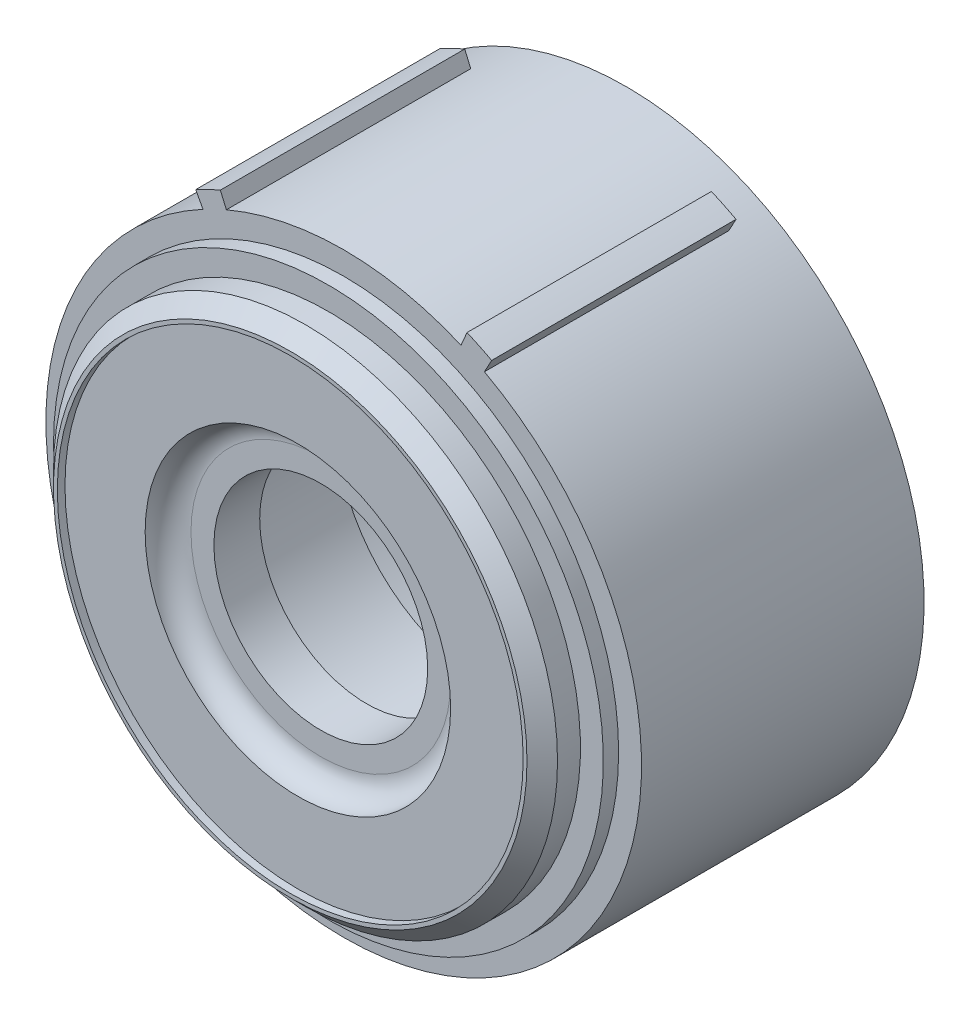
ISO-10303-21;
HEADER;
FILE_DESCRIPTION(('STEP AP214'),'2;1');
FILE_NAME('part.step','',(''),(''),'','','');
FILE_SCHEMA(('AUTOMOTIVE_DESIGN { 1 0 10303 214 1 1 1 1 }'));
ENDSEC;
DATA;
#1=APPLICATION_CONTEXT('core data for automotive mechanical design processes');
#2=APPLICATION_PROTOCOL_DEFINITION('international standard','automotive_design',2000,#1);
#3=PRODUCT_CONTEXT('',#1,'mechanical');
#4=PRODUCT('Part','Part','',(#3));
#5=PRODUCT_RELATED_PRODUCT_CATEGORY('part','',(#4));
#6=PRODUCT_DEFINITION_FORMATION('','',#4);
#7=PRODUCT_DEFINITION_CONTEXT('part definition',#1,'design');
#8=PRODUCT_DEFINITION('design','',#6,#7);
#9=PRODUCT_DEFINITION_SHAPE('','',#8);
#10=(LENGTH_UNIT() NAMED_UNIT(*) SI_UNIT(.MILLI.,.METRE.));
#11=(NAMED_UNIT(*) PLANE_ANGLE_UNIT() SI_UNIT($,.RADIAN.));
#12=(NAMED_UNIT(*) SI_UNIT($,.STERADIAN.) SOLID_ANGLE_UNIT());
#13=UNCERTAINTY_MEASURE_WITH_UNIT(LENGTH_MEASURE(1.E-05),#10,'distance_accuracy_value','');
#14=(GEOMETRIC_REPRESENTATION_CONTEXT(3) GLOBAL_UNCERTAINTY_ASSIGNED_CONTEXT((#13)) GLOBAL_UNIT_ASSIGNED_CONTEXT((#10,
#11,#12)) REPRESENTATION_CONTEXT('',''));
#15=CARTESIAN_POINT('',(0.,0.,0.));
#16=DIRECTION('',(0.,0.,1.));
#17=DIRECTION('',(1.,0.,0.));
#18=AXIS2_PLACEMENT_3D('',#15,#16,#17);
#19=CARTESIAN_POINT('',(0.,0.,-3.));
#20=DIRECTION('',(0.,0.,-1.));
#21=DIRECTION('',(-1.,0.,0.));
#22=AXIS2_PLACEMENT_3D('',#19,#20,#21);
#23=PLANE('',#22);
#24=CARTESIAN_POINT('',(0.,0.,-3.));
#25=DIRECTION('',(0.,0.,-1.));
#26=DIRECTION('',(-1.,0.,0.));
#27=AXIS2_PLACEMENT_3D('',#24,#25,#26);
#28=CIRCLE('',#27,23.);
#29=CARTESIAN_POINT('',(17.2894925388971,15.1681721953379,-3.));
#30=VERTEX_POINT('',#29);
#31=CARTESIAN_POINT('',(22.951034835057,1.50000000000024,-3.));
#32=VERTEX_POINT('',#31);
#33=EDGE_CURVE('E307',#30,#32,#28,.T.);
#34=ORIENTED_EDGE('',*,*,#33,.F.);
#35=DIRECTION('',(-0.707106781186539,-0.707106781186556,0.));
#36=VECTOR('',#35,1.);
#37=CARTESIAN_POINT('',(26.4943976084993,24.3730772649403,-3.));
#38=LINE('',#37,#36);
#39=CARTESIAN_POINT('',(26.4943976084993,24.3730772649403,-3.));
#40=VERTEX_POINT('',#39);
#41=EDGE_CURVE('E294',#40,#30,#38,.T.);
#42=ORIENTED_EDGE('',*,*,#41,.F.);
#43=CARTESIAN_POINT('',(0.,0.,-3.));
#44=DIRECTION('',(0.,0.,-1.));
#45=DIRECTION('',(-1.,0.,0.));
#46=AXIS2_PLACEMENT_3D('',#43,#44,#45);
#47=CIRCLE('',#46,36.);
#48=CARTESIAN_POINT('',(35.9687364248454,1.50000000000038,-3.));
#49=VERTEX_POINT('',#48);
#50=EDGE_CURVE('E305',#40,#49,#47,.T.);
#51=ORIENTED_EDGE('',*,*,#50,.T.);
#52=DIRECTION('',(1.,0.,0.));
#53=VECTOR('',#52,1.);
#54=CARTESIAN_POINT('',(35.9687364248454,1.50000000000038,-3.));
#55=LINE('',#54,#53);
#56=EDGE_CURVE('E495',#32,#49,#55,.T.);
#57=ORIENTED_EDGE('',*,*,#56,.F.);
#58=EDGE_LOOP('',(#34,#42,#51,#57));
#59=FACE_BOUND('',#58,.T.);
#60=ADVANCED_FACE('F36',(#59),#23,.T.);
#61=CARTESIAN_POINT('',(1.5,35.9687364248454,-3.));
#62=VERTEX_POINT('',#61);
#63=CARTESIAN_POINT('',(24.3730772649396,26.4943976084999,-3.));
#64=VERTEX_POINT('',#63);
#65=EDGE_CURVE('E315',#62,#64,#47,.T.);
#66=ORIENTED_EDGE('',*,*,#65,.T.);
#67=DIRECTION('',(0.707106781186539,0.707106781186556,0.));
#68=VECTOR('',#67,1.);
#69=CARTESIAN_POINT('',(24.3730772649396,26.4943976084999,-3.));
#70=LINE('',#69,#68);
#71=CARTESIAN_POINT('',(15.1681721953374,17.2894925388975,-3.));
#72=VERTEX_POINT('',#71);
#73=EDGE_CURVE('E308',#72,#64,#70,.T.);
#74=ORIENTED_EDGE('',*,*,#73,.F.);
#75=CARTESIAN_POINT('',(1.5,22.951034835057,-3.));
#76=VERTEX_POINT('',#75);
#77=EDGE_CURVE('E671',#76,#72,#28,.T.);
#78=ORIENTED_EDGE('',*,*,#77,.F.);
#79=DIRECTION('',(0.,-1.,0.));
#80=VECTOR('',#79,1.);
#81=CARTESIAN_POINT('',(1.5,35.9687364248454,-3.));
#82=LINE('',#81,#80);
#83=EDGE_CURVE('E642',#62,#76,#82,.T.);
#84=ORIENTED_EDGE('',*,*,#83,.F.);
#85=EDGE_LOOP('',(#66,#74,#78,#84));
#86=FACE_BOUND('',#85,.T.);
#87=ADVANCED_FACE('F435',(#86),#23,.T.);
#88=CARTESIAN_POINT('',(0.,0.,-3.));
#89=DIRECTION('',(0.,0.,-1.));
#90=DIRECTION('',(-1.,0.,0.));
#91=AXIS2_PLACEMENT_3D('',#88,#89,#90);
#92=CYLINDRICAL_SURFACE('',#91,36.);
#93=CARTESIAN_POINT('',(0.,0.,-37.));
#94=DIRECTION('',(0.,0.,-1.));
#95=DIRECTION('',(-1.,0.,0.));
#96=AXIS2_PLACEMENT_3D('',#93,#94,#95);
#97=CIRCLE('',#96,36.);
#98=CARTESIAN_POINT('',(-36.,0.,-37.));
#99=VERTEX_POINT('',#98);
#100=EDGE_CURVE('E324',#99,#99,#97,.T.);
#101=ORIENTED_EDGE('',*,*,#100,.T.);
#102=EDGE_LOOP('',(#101));
#103=FACE_BOUND('',#102,.T.);
#104=DIRECTION('',(0.,0.,1.));
#105=VECTOR('',#104,1.);
#106=CARTESIAN_POINT('',(26.4943976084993,24.3730772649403,-13.));
#107=LINE('',#106,#105);
#108=CARTESIAN_POINT('',(26.4943976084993,24.3730772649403,-13.));
#109=VERTEX_POINT('',#108);
#110=EDGE_CURVE('E291',#109,#40,#107,.T.);
#111=ORIENTED_EDGE('',*,*,#110,.F.);
#112=CARTESIAN_POINT('',(0.,0.,-13.));
#113=DIRECTION('',(0.,0.,-1.));
#114=DIRECTION('',(-0.707106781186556,0.707106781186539,0.));
#115=AXIS2_PLACEMENT_3D('',#112,#113,#114);
#116=CIRCLE('',#115,36.);
#117=CARTESIAN_POINT('',(24.3730772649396,26.4943976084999,-13.));
#118=VERTEX_POINT('',#117);
#119=EDGE_CURVE('E739',#118,#109,#116,.T.);
#120=ORIENTED_EDGE('',*,*,#119,.F.);
#121=DIRECTION('',(0.,0.,1.));
#122=VECTOR('',#121,1.);
#123=CARTESIAN_POINT('',(24.3730772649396,26.4943976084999,-13.));
#124=LINE('',#123,#122);
#125=EDGE_CURVE('E490',#118,#64,#124,.T.);
#126=ORIENTED_EDGE('',*,*,#125,.T.);
#127=ORIENTED_EDGE('',*,*,#65,.F.);
#128=DIRECTION('',(0.,0.,1.));
#129=VECTOR('',#128,1.);
#130=CARTESIAN_POINT('',(1.5,35.9687364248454,-13.));
#131=LINE('',#130,#129);
#132=CARTESIAN_POINT('',(1.5,35.9687364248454,-13.));
#133=VERTEX_POINT('',#132);
#134=EDGE_CURVE('E666',#133,#62,#131,.T.);
#135=ORIENTED_EDGE('',*,*,#134,.F.);
#136=CARTESIAN_POINT('',(0.,0.,-13.));
#137=DIRECTION('',(0.,0.,-1.));
#138=DIRECTION('',(-1.,0.,0.));
#139=AXIS2_PLACEMENT_3D('',#136,#137,#138);
#140=CIRCLE('',#139,36.);
#141=CARTESIAN_POINT('',(-1.5,35.9687364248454,-13.));
#142=VERTEX_POINT('',#141);
#143=EDGE_CURVE('E647',#142,#133,#140,.T.);
#144=ORIENTED_EDGE('',*,*,#143,.F.);
#145=DIRECTION('',(0.,0.,1.));
#146=VECTOR('',#145,1.);
#147=CARTESIAN_POINT('',(-1.5,35.9687364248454,-13.));
#148=LINE('',#147,#146);
#149=CARTESIAN_POINT('',(-1.5,35.9687364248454,-3.));
#150=VERTEX_POINT('',#149);
#151=EDGE_CURVE('E657',#142,#150,#148,.T.);
#152=ORIENTED_EDGE('',*,*,#151,.T.);
#153=CARTESIAN_POINT('',(-24.37307726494,26.4943976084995,-3.));
#154=VERTEX_POINT('',#153);
#155=EDGE_CURVE('E320',#154,#150,#47,.T.);
#156=ORIENTED_EDGE('',*,*,#155,.F.);
#157=DIRECTION('',(0.,0.,1.));
#158=VECTOR('',#157,1.);
#159=CARTESIAN_POINT('',(-24.37307726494,26.4943976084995,-13.));
#160=LINE('',#159,#158);
#161=CARTESIAN_POINT('',(-24.37307726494,26.4943976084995,-13.));
#162=VERTEX_POINT('',#161);
#163=EDGE_CURVE('E640',#162,#154,#160,.T.);
#164=ORIENTED_EDGE('',*,*,#163,.F.);
#165=CARTESIAN_POINT('',(0.,0.,-13.));
#166=DIRECTION('',(0.,0.,-1.));
#167=DIRECTION('',(-0.707106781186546,-0.707106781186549,0.));
#168=AXIS2_PLACEMENT_3D('',#165,#166,#167);
#169=CIRCLE('',#168,36.);
#170=CARTESIAN_POINT('',(-26.4943976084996,24.3730772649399,-13.));
#171=VERTEX_POINT('',#170);
#172=EDGE_CURVE('E621',#171,#162,#169,.T.);
#173=ORIENTED_EDGE('',*,*,#172,.F.);
#174=DIRECTION('',(0.,0.,1.));
#175=VECTOR('',#174,1.);
#176=CARTESIAN_POINT('',(-26.4943976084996,24.3730772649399,-13.));
#177=LINE('',#176,#175);
#178=CARTESIAN_POINT('',(-26.4943976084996,24.3730772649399,-3.));
#179=VERTEX_POINT('',#178);
#180=EDGE_CURVE('E631',#171,#179,#177,.T.);
#181=ORIENTED_EDGE('',*,*,#180,.T.);
#182=CARTESIAN_POINT('',(-35.9687364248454,1.49999999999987,-3.));
#183=VERTEX_POINT('',#182);
#184=EDGE_CURVE('E675',#183,#179,#47,.T.);
#185=ORIENTED_EDGE('',*,*,#184,.F.);
#186=DIRECTION('',(0.,0.,1.));
#187=VECTOR('',#186,1.);
#188=CARTESIAN_POINT('',(-35.9687364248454,1.49999999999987,-13.));
#189=LINE('',#188,#187);
#190=CARTESIAN_POINT('',(-35.9687364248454,1.49999999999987,-13.));
#191=VERTEX_POINT('',#190);
#192=EDGE_CURVE('E614',#191,#183,#189,.T.);
#193=ORIENTED_EDGE('',*,*,#192,.F.);
#194=CARTESIAN_POINT('',(0.,0.,-13.));
#195=DIRECTION('',(0.,0.,-1.));
#196=DIRECTION('',(0.,-1.,0.));
#197=AXIS2_PLACEMENT_3D('',#194,#195,#196);
#198=CIRCLE('',#197,36.);
#199=CARTESIAN_POINT('',(-35.9687364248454,-1.50000000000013,-13.));
#200=VERTEX_POINT('',#199);
#201=EDGE_CURVE('E595',#200,#191,#198,.T.);
#202=ORIENTED_EDGE('',*,*,#201,.F.);
#203=DIRECTION('',(0.,0.,1.));
#204=VECTOR('',#203,1.);
#205=CARTESIAN_POINT('',(-35.9687364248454,-1.50000000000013,-13.));
#206=LINE('',#205,#204);
#207=CARTESIAN_POINT('',(-35.9687364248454,-1.50000000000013,-3.));
#208=VERTEX_POINT('',#207);
#209=EDGE_CURVE('E605',#200,#208,#206,.T.);
#210=ORIENTED_EDGE('',*,*,#209,.T.);
#211=CARTESIAN_POINT('',(-26.4943976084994,-24.3730772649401,-3.));
#212=VERTEX_POINT('',#211);
#213=EDGE_CURVE('E679',#212,#208,#47,.T.);
#214=ORIENTED_EDGE('',*,*,#213,.F.);
#215=DIRECTION('',(0.,0.,1.));
#216=VECTOR('',#215,1.);
#217=CARTESIAN_POINT('',(-26.4943976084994,-24.3730772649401,-13.));
#218=LINE('',#217,#216);
#219=CARTESIAN_POINT('',(-26.4943976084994,-24.3730772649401,-13.));
#220=VERTEX_POINT('',#219);
#221=EDGE_CURVE('E588',#220,#212,#218,.T.);
#222=ORIENTED_EDGE('',*,*,#221,.F.);
#223=CARTESIAN_POINT('',(0.,0.,-13.));
#224=DIRECTION('',(0.,0.,-1.));
#225=DIRECTION('',(0.707106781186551,-0.707106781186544,0.));
#226=AXIS2_PLACEMENT_3D('',#223,#224,#225);
#227=CIRCLE('',#226,36.);
#228=CARTESIAN_POINT('',(-24.3730772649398,-26.4943976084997,-13.));
#229=VERTEX_POINT('',#228);
#230=EDGE_CURVE('E569',#229,#220,#227,.T.);
#231=ORIENTED_EDGE('',*,*,#230,.F.);
#232=DIRECTION('',(0.,0.,1.));
#233=VECTOR('',#232,1.);
#234=CARTESIAN_POINT('',(-24.3730772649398,-26.4943976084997,-13.));
#235=LINE('',#234,#233);
#236=CARTESIAN_POINT('',(-24.3730772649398,-26.4943976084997,-3.));
#237=VERTEX_POINT('',#236);
#238=EDGE_CURVE('E579',#229,#237,#235,.T.);
#239=ORIENTED_EDGE('',*,*,#238,.T.);
#240=CARTESIAN_POINT('',(-1.49999999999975,-35.9687364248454,-3.));
#241=VERTEX_POINT('',#240);
#242=EDGE_CURVE('E684',#241,#237,#47,.T.);
#243=ORIENTED_EDGE('',*,*,#242,.F.);
#244=DIRECTION('',(0.,0.,1.));
#245=VECTOR('',#244,1.);
#246=CARTESIAN_POINT('',(-1.49999999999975,-35.9687364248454,-13.));
#247=LINE('',#246,#245);
#248=CARTESIAN_POINT('',(-1.49999999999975,-35.9687364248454,-13.));
#249=VERTEX_POINT('',#248);
#250=EDGE_CURVE('E562',#249,#241,#247,.T.);
#251=ORIENTED_EDGE('',*,*,#250,.F.);
#252=CARTESIAN_POINT('',(0.,0.,-13.));
#253=DIRECTION('',(0.,0.,-1.));
#254=DIRECTION('',(1.,0.,0.));
#255=AXIS2_PLACEMENT_3D('',#252,#253,#254);
#256=CIRCLE('',#255,36.);
#257=CARTESIAN_POINT('',(1.50000000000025,-35.9687364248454,-13.));
#258=VERTEX_POINT('',#257);
#259=EDGE_CURVE('E543',#258,#249,#256,.T.);
#260=ORIENTED_EDGE('',*,*,#259,.F.);
#261=DIRECTION('',(0.,0.,1.));
#262=VECTOR('',#261,1.);
#263=CARTESIAN_POINT('',(1.50000000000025,-35.9687364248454,-13.));
#264=LINE('',#263,#262);
#265=CARTESIAN_POINT('',(1.50000000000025,-35.9687364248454,-3.));
#266=VERTEX_POINT('',#265);
#267=EDGE_CURVE('E553',#258,#266,#264,.T.);
#268=ORIENTED_EDGE('',*,*,#267,.T.);
#269=CARTESIAN_POINT('',(24.3730772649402,-26.4943976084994,-3.));
#270=VERTEX_POINT('',#269);
#271=EDGE_CURVE('E321',#270,#266,#47,.T.);
#272=ORIENTED_EDGE('',*,*,#271,.F.);
#273=DIRECTION('',(0.,0.,1.));
#274=VECTOR('',#273,1.);
#275=CARTESIAN_POINT('',(24.3730772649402,-26.4943976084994,-13.));
#276=LINE('',#275,#274);
#277=CARTESIAN_POINT('',(24.3730772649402,-26.4943976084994,-13.));
#278=VERTEX_POINT('',#277);
#279=EDGE_CURVE('E536',#278,#270,#276,.T.);
#280=ORIENTED_EDGE('',*,*,#279,.F.);
#281=CARTESIAN_POINT('',(0.,0.,-13.));
#282=DIRECTION('',(0.,0.,-1.));
#283=DIRECTION('',(0.707106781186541,0.707106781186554,0.));
#284=AXIS2_PLACEMENT_3D('',#281,#282,#283);
#285=CIRCLE('',#284,36.);
#286=CARTESIAN_POINT('',(26.4943976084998,-24.3730772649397,-13.));
#287=VERTEX_POINT('',#286);
#288=EDGE_CURVE('E517',#287,#278,#285,.T.);
#289=ORIENTED_EDGE('',*,*,#288,.F.);
#290=DIRECTION('',(0.,0.,1.));
#291=VECTOR('',#290,1.);
#292=CARTESIAN_POINT('',(26.4943976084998,-24.3730772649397,-13.));
#293=LINE('',#292,#291);
#294=CARTESIAN_POINT('',(26.4943976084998,-24.3730772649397,-3.));
#295=VERTEX_POINT('',#294);
#296=EDGE_CURVE('E527',#287,#295,#293,.T.);
#297=ORIENTED_EDGE('',*,*,#296,.T.);
#298=CARTESIAN_POINT('',(35.9687364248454,-1.49999999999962,-3.));
#299=VERTEX_POINT('',#298);
#300=EDGE_CURVE('E316',#299,#295,#47,.T.);
#301=ORIENTED_EDGE('',*,*,#300,.F.);
#302=DIRECTION('',(0.,0.,1.));
#303=VECTOR('',#302,1.);
#304=CARTESIAN_POINT('',(35.9687364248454,-1.49999999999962,-13.));
#305=LINE('',#304,#303);
#306=CARTESIAN_POINT('',(35.9687364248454,-1.49999999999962,-13.));
#307=VERTEX_POINT('',#306);
#308=EDGE_CURVE('E510',#307,#299,#305,.T.);
#309=ORIENTED_EDGE('',*,*,#308,.F.);
#310=CARTESIAN_POINT('',(0.,0.,-13.));
#311=DIRECTION('',(0.,0.,-1.));
#312=DIRECTION('',(0.,1.,0.));
#313=AXIS2_PLACEMENT_3D('',#310,#311,#312);
#314=CIRCLE('',#313,36.);
#315=CARTESIAN_POINT('',(35.9687364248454,1.50000000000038,-13.));
#316=VERTEX_POINT('',#315);
#317=EDGE_CURVE('E497',#316,#307,#314,.T.);
#318=ORIENTED_EDGE('',*,*,#317,.F.);
#319=DIRECTION('',(0.,0.,1.));
#320=VECTOR('',#319,1.);
#321=CARTESIAN_POINT('',(35.9687364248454,1.50000000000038,-13.));
#322=LINE('',#321,#320);
#323=EDGE_CURVE('E314',#316,#49,#322,.T.);
#324=ORIENTED_EDGE('',*,*,#323,.T.);
#325=ORIENTED_EDGE('',*,*,#50,.F.);
#326=EDGE_LOOP('',(#111,#120,#126,#127,#135,#144,#152,#156,#164,#173,#181,#185,#193,#202,#210,
#214,#222,#231,#239,#243,#251,#260,#268,#272,#280,#289,#297,#301,#309,#318,#324,#325));
#327=FACE_BOUND('',#326,.T.);
#328=ADVANCED_FACE('F311',(#103,#327),#92,.F.);
#329=CARTESIAN_POINT('',(0.,0.,-19.));
#330=DIRECTION('',(0.,0.,1.));
#331=DIRECTION('',(1.,0.,0.));
#332=AXIS2_PLACEMENT_3D('',#329,#330,#331);
#333=CYLINDRICAL_SURFACE('',#332,23.);
#334=CARTESIAN_POINT('',(0.,0.,-19.));
#335=DIRECTION('',(0.,0.,-1.));
#336=DIRECTION('',(-1.,0.,0.));
#337=AXIS2_PLACEMENT_3D('',#334,#335,#336);
#338=CIRCLE('',#337,23.);
#339=CARTESIAN_POINT('',(-23.,0.,-19.));
#340=VERTEX_POINT('',#339);
#341=EDGE_CURVE('E482',#340,#340,#338,.T.);
#342=ORIENTED_EDGE('',*,*,#341,.F.);
#343=EDGE_LOOP('',(#342));
#344=FACE_BOUND('',#343,.T.);
#345=DIRECTION('',(0.,0.,1.));
#346=VECTOR('',#345,1.);
#347=CARTESIAN_POINT('',(17.2894925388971,15.1681721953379,-13.));
#348=LINE('',#347,#346);
#349=CARTESIAN_POINT('',(17.2894925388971,15.1681721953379,-13.));
#350=VERTEX_POINT('',#349);
#351=EDGE_CURVE('E51',#350,#30,#348,.T.);
#352=ORIENTED_EDGE('',*,*,#351,.T.);
#353=ORIENTED_EDGE('',*,*,#33,.T.);
#354=DIRECTION('',(0.,0.,1.));
#355=VECTOR('',#354,1.);
#356=CARTESIAN_POINT('',(22.951034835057,1.50000000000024,-13.));
#357=LINE('',#356,#355);
#358=CARTESIAN_POINT('',(22.951034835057,1.50000000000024,-13.));
#359=VERTEX_POINT('',#358);
#360=EDGE_CURVE('E507',#359,#32,#357,.T.);
#361=ORIENTED_EDGE('',*,*,#360,.F.);
#362=CARTESIAN_POINT('',(0.,0.,-13.));
#363=DIRECTION('',(0.,0.,1.));
#364=DIRECTION('',(0.,1.,0.));
#365=AXIS2_PLACEMENT_3D('',#362,#363,#364);
#366=CIRCLE('',#365,23.);
#367=CARTESIAN_POINT('',(22.951034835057,-1.49999999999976,-13.));
#368=VERTEX_POINT('',#367);
#369=EDGE_CURVE('E502',#368,#359,#366,.T.);
#370=ORIENTED_EDGE('',*,*,#369,.F.);
#371=DIRECTION('',(0.,0.,1.));
#372=VECTOR('',#371,1.);
#373=CARTESIAN_POINT('',(22.951034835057,-1.49999999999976,-13.));
#374=LINE('',#373,#372);
#375=CARTESIAN_POINT('',(22.951034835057,-1.49999999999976,-3.));
#376=VERTEX_POINT('',#375);
#377=EDGE_CURVE('E59',#368,#376,#374,.T.);
#378=ORIENTED_EDGE('',*,*,#377,.T.);
#379=CARTESIAN_POINT('',(17.2894925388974,-15.1681721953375,-3.));
#380=VERTEX_POINT('',#379);
#381=EDGE_CURVE('E711',#376,#380,#28,.T.);
#382=ORIENTED_EDGE('',*,*,#381,.T.);
#383=DIRECTION('',(0.,0.,1.));
#384=VECTOR('',#383,1.);
#385=CARTESIAN_POINT('',(17.2894925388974,-15.1681721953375,-13.));
#386=LINE('',#385,#384);
#387=CARTESIAN_POINT('',(17.2894925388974,-15.1681721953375,-13.));
#388=VERTEX_POINT('',#387);
#389=EDGE_CURVE('E530',#388,#380,#386,.T.);
#390=ORIENTED_EDGE('',*,*,#389,.F.);
#391=CARTESIAN_POINT('',(0.,0.,-13.));
#392=DIRECTION('',(0.,0.,1.));
#393=DIRECTION('',(0.707106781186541,0.707106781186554,0.));
#394=AXIS2_PLACEMENT_3D('',#391,#392,#393);
#395=CIRCLE('',#394,23.);
#396=CARTESIAN_POINT('',(15.1681721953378,-17.2894925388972,-13.));
#397=VERTEX_POINT('',#396);
#398=EDGE_CURVE('E523',#397,#388,#395,.T.);
#399=ORIENTED_EDGE('',*,*,#398,.F.);
#400=DIRECTION('',(0.,0.,1.));
#401=VECTOR('',#400,1.);
#402=CARTESIAN_POINT('',(15.1681721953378,-17.2894925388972,-13.));
#403=LINE('',#402,#401);
#404=CARTESIAN_POINT('',(15.1681721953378,-17.2894925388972,-3.));
#405=VERTEX_POINT('',#404);
#406=EDGE_CURVE('E533',#397,#405,#403,.T.);
#407=ORIENTED_EDGE('',*,*,#406,.T.);
#408=CARTESIAN_POINT('',(1.50000000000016,-22.951034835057,-3.));
#409=VERTEX_POINT('',#408);
#410=EDGE_CURVE('E709',#405,#409,#28,.T.);
#411=ORIENTED_EDGE('',*,*,#410,.T.);
#412=DIRECTION('',(0.,0.,1.));
#413=VECTOR('',#412,1.);
#414=CARTESIAN_POINT('',(1.50000000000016,-22.951034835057,-13.));
#415=LINE('',#414,#413);
#416=CARTESIAN_POINT('',(1.50000000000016,-22.951034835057,-13.));
#417=VERTEX_POINT('',#416);
#418=EDGE_CURVE('E556',#417,#409,#415,.T.);
#419=ORIENTED_EDGE('',*,*,#418,.F.);
#420=CARTESIAN_POINT('',(0.,0.,-13.));
#421=DIRECTION('',(0.,0.,1.));
#422=DIRECTION('',(1.,0.,0.));
#423=AXIS2_PLACEMENT_3D('',#420,#421,#422);
#424=CIRCLE('',#423,23.);
#425=CARTESIAN_POINT('',(-1.49999999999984,-22.951034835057,-13.));
#426=VERTEX_POINT('',#425);
#427=EDGE_CURVE('E549',#426,#417,#424,.T.);
#428=ORIENTED_EDGE('',*,*,#427,.F.);
#429=DIRECTION('',(0.,0.,1.));
#430=VECTOR('',#429,1.);
#431=CARTESIAN_POINT('',(-1.49999999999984,-22.951034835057,-13.));
#432=LINE('',#431,#430);
#433=CARTESIAN_POINT('',(-1.49999999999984,-22.951034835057,-3.));
#434=VERTEX_POINT('',#433);
#435=EDGE_CURVE('E559',#426,#434,#432,.T.);
#436=ORIENTED_EDGE('',*,*,#435,.T.);
#437=CARTESIAN_POINT('',(-15.1681721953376,-17.2894925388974,-3.));
#438=VERTEX_POINT('',#437);
#439=EDGE_CURVE('E712',#434,#438,#28,.T.);
#440=ORIENTED_EDGE('',*,*,#439,.T.);
#441=DIRECTION('',(0.,0.,1.));
#442=VECTOR('',#441,1.);
#443=CARTESIAN_POINT('',(-15.1681721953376,-17.2894925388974,-13.));
#444=LINE('',#443,#442);
#445=CARTESIAN_POINT('',(-15.1681721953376,-17.2894925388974,-13.));
#446=VERTEX_POINT('',#445);
#447=EDGE_CURVE('E582',#446,#438,#444,.T.);
#448=ORIENTED_EDGE('',*,*,#447,.F.);
#449=CARTESIAN_POINT('',(0.,0.,-13.));
#450=DIRECTION('',(0.,0.,1.));
#451=DIRECTION('',(0.707106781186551,-0.707106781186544,0.));
#452=AXIS2_PLACEMENT_3D('',#449,#450,#451);
#453=CIRCLE('',#452,23.);
#454=CARTESIAN_POINT('',(-17.2894925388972,-15.1681721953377,-13.));
#455=VERTEX_POINT('',#454);
#456=EDGE_CURVE('E575',#455,#446,#453,.T.);
#457=ORIENTED_EDGE('',*,*,#456,.F.);
#458=DIRECTION('',(0.,0.,1.));
#459=VECTOR('',#458,1.);
#460=CARTESIAN_POINT('',(-17.2894925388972,-15.1681721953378,-13.));
#461=LINE('',#460,#459);
#462=CARTESIAN_POINT('',(-17.2894925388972,-15.1681721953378,-3.));
#463=VERTEX_POINT('',#462);
#464=EDGE_CURVE('E585',#455,#463,#461,.T.);
#465=ORIENTED_EDGE('',*,*,#464,.T.);
#466=CARTESIAN_POINT('',(-22.951034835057,-1.50000000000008,-3.));
#467=VERTEX_POINT('',#466);
#468=EDGE_CURVE('E713',#463,#467,#28,.T.);
#469=ORIENTED_EDGE('',*,*,#468,.T.);
#470=DIRECTION('',(0.,0.,1.));
#471=VECTOR('',#470,1.);
#472=CARTESIAN_POINT('',(-22.951034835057,-1.50000000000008,-13.));
#473=LINE('',#472,#471);
#474=CARTESIAN_POINT('',(-22.951034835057,-1.50000000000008,-13.));
#475=VERTEX_POINT('',#474);
#476=EDGE_CURVE('E608',#475,#467,#473,.T.);
#477=ORIENTED_EDGE('',*,*,#476,.F.);
#478=CARTESIAN_POINT('',(0.,0.,-13.));
#479=DIRECTION('',(0.,0.,1.));
#480=DIRECTION('',(0.,-1.,0.));
#481=AXIS2_PLACEMENT_3D('',#478,#479,#480);
#482=CIRCLE('',#481,23.);
#483=CARTESIAN_POINT('',(-22.951034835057,1.49999999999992,-13.));
#484=VERTEX_POINT('',#483);
#485=EDGE_CURVE('E601',#484,#475,#482,.T.);
#486=ORIENTED_EDGE('',*,*,#485,.F.);
#487=DIRECTION('',(0.,0.,1.));
#488=VECTOR('',#487,1.);
#489=CARTESIAN_POINT('',(-22.951034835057,1.49999999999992,-13.));
#490=LINE('',#489,#488);
#491=CARTESIAN_POINT('',(-22.951034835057,1.49999999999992,-3.));
#492=VERTEX_POINT('',#491);
#493=EDGE_CURVE('E611',#484,#492,#490,.T.);
#494=ORIENTED_EDGE('',*,*,#493,.T.);
#495=CARTESIAN_POINT('',(-17.2894925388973,15.1681721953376,-3.));
#496=VERTEX_POINT('',#495);
#497=EDGE_CURVE('E716',#492,#496,#28,.T.);
#498=ORIENTED_EDGE('',*,*,#497,.T.);
#499=DIRECTION('',(0.,0.,1.));
#500=VECTOR('',#499,1.);
#501=CARTESIAN_POINT('',(-17.2894925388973,15.1681721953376,-13.));
#502=LINE('',#501,#500);
#503=CARTESIAN_POINT('',(-17.2894925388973,15.1681721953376,-13.));
#504=VERTEX_POINT('',#503);
#505=EDGE_CURVE('E634',#504,#496,#502,.T.);
#506=ORIENTED_EDGE('',*,*,#505,.F.);
#507=CARTESIAN_POINT('',(0.,0.,-13.));
#508=DIRECTION('',(0.,0.,1.));
#509=DIRECTION('',(-0.707106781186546,-0.707106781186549,0.));
#510=AXIS2_PLACEMENT_3D('',#507,#508,#509);
#511=CIRCLE('',#510,23.);
#512=CARTESIAN_POINT('',(-15.1681721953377,17.2894925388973,-13.));
#513=VERTEX_POINT('',#512);
#514=EDGE_CURVE('E627',#513,#504,#511,.T.);
#515=ORIENTED_EDGE('',*,*,#514,.F.);
#516=DIRECTION('',(0.,0.,1.));
#517=VECTOR('',#516,1.);
#518=CARTESIAN_POINT('',(-15.1681721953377,17.2894925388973,-13.));
#519=LINE('',#518,#517);
#520=CARTESIAN_POINT('',(-15.1681721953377,17.2894925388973,-3.));
#521=VERTEX_POINT('',#520);
#522=EDGE_CURVE('E637',#513,#521,#519,.T.);
#523=ORIENTED_EDGE('',*,*,#522,.T.);
#524=CARTESIAN_POINT('',(-1.5,22.951034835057,-3.));
#525=VERTEX_POINT('',#524);
#526=EDGE_CURVE('E670',#521,#525,#28,.T.);
#527=ORIENTED_EDGE('',*,*,#526,.T.);
#528=DIRECTION('',(0.,0.,1.));
#529=VECTOR('',#528,1.);
#530=CARTESIAN_POINT('',(-1.5,22.951034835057,-13.));
#531=LINE('',#530,#529);
#532=CARTESIAN_POINT('',(-1.5,22.951034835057,-13.));
#533=VERTEX_POINT('',#532);
#534=EDGE_CURVE('E660',#533,#525,#531,.T.);
#535=ORIENTED_EDGE('',*,*,#534,.F.);
#536=CARTESIAN_POINT('',(0.,0.,-13.));
#537=DIRECTION('',(0.,0.,1.));
#538=DIRECTION('',(-1.,0.,0.));
#539=AXIS2_PLACEMENT_3D('',#536,#537,#538);
#540=CIRCLE('',#539,23.);
#541=CARTESIAN_POINT('',(1.5,22.951034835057,-13.));
#542=VERTEX_POINT('',#541);
#543=EDGE_CURVE('E653',#542,#533,#540,.T.);
#544=ORIENTED_EDGE('',*,*,#543,.F.);
#545=DIRECTION('',(0.,0.,1.));
#546=VECTOR('',#545,1.);
#547=CARTESIAN_POINT('',(1.5,22.951034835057,-13.));
#548=LINE('',#547,#546);
#549=EDGE_CURVE('E663',#542,#76,#548,.T.);
#550=ORIENTED_EDGE('',*,*,#549,.T.);
#551=ORIENTED_EDGE('',*,*,#77,.T.);
#552=DIRECTION('',(0.,0.,1.));
#553=VECTOR('',#552,1.);
#554=CARTESIAN_POINT('',(15.1681721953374,17.2894925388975,-13.));
#555=LINE('',#554,#553);
#556=CARTESIAN_POINT('',(15.1681721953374,17.2894925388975,-13.));
#557=VERTEX_POINT('',#556);
#558=EDGE_CURVE('E488',#557,#72,#555,.T.);
#559=ORIENTED_EDGE('',*,*,#558,.F.);
#560=CARTESIAN_POINT('',(0.,0.,-13.));
#561=DIRECTION('',(0.,0.,1.));
#562=DIRECTION('',(-0.707106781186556,0.707106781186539,0.));
#563=AXIS2_PLACEMENT_3D('',#560,#561,#562);
#564=CIRCLE('',#563,23.);
#565=EDGE_CURVE('E487',#350,#557,#564,.T.);
#566=ORIENTED_EDGE('',*,*,#565,.F.);
#567=EDGE_LOOP('',(#352,#353,#361,#370,#378,#382,#390,#399,#407,#411,#419,#428,#436,#440,#448,
#457,#465,#469,#477,#486,#494,#498,#506,#515,#523,#527,#535,#544,#550,#551,#559,#566));
#568=FACE_BOUND('',#567,.T.);
#569=ADVANCED_FACE('F469',(#344,#568),#333,.T.);
#570=ORIENTED_EDGE('',*,*,#381,.F.);
#571=DIRECTION('',(-1.,0.,0.));
#572=VECTOR('',#571,1.);
#573=CARTESIAN_POINT('',(35.9687364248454,-1.49999999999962,-3.));
#574=LINE('',#573,#572);
#575=EDGE_CURVE('E300',#299,#376,#574,.T.);
#576=ORIENTED_EDGE('',*,*,#575,.F.);
#577=ORIENTED_EDGE('',*,*,#300,.T.);
#578=DIRECTION('',(0.707106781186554,-0.707106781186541,0.));
#579=VECTOR('',#578,1.);
#580=CARTESIAN_POINT('',(26.4943976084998,-24.3730772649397,-3.));
#581=LINE('',#580,#579);
#582=EDGE_CURVE('E514',#380,#295,#581,.T.);
#583=ORIENTED_EDGE('',*,*,#582,.F.);
#584=EDGE_LOOP('',(#570,#576,#577,#583));
#585=FACE_BOUND('',#584,.T.);
#586=ADVANCED_FACE('F440',(#585),#23,.T.);
#587=ORIENTED_EDGE('',*,*,#410,.F.);
#588=DIRECTION('',(-0.707106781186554,0.707106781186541,0.));
#589=VECTOR('',#588,1.);
#590=CARTESIAN_POINT('',(24.3730772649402,-26.4943976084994,-3.));
#591=LINE('',#590,#589);
#592=EDGE_CURVE('E512',#270,#405,#591,.T.);
#593=ORIENTED_EDGE('',*,*,#592,.F.);
#594=ORIENTED_EDGE('',*,*,#271,.T.);
#595=DIRECTION('',(0.,-1.,0.));
#596=VECTOR('',#595,1.);
#597=CARTESIAN_POINT('',(1.50000000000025,-35.9687364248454,-3.));
#598=LINE('',#597,#596);
#599=EDGE_CURVE('E540',#409,#266,#598,.T.);
#600=ORIENTED_EDGE('',*,*,#599,.F.);
#601=EDGE_LOOP('',(#587,#593,#594,#600));
#602=FACE_BOUND('',#601,.T.);
#603=ADVANCED_FACE('F476',(#602),#23,.T.);
#604=ORIENTED_EDGE('',*,*,#439,.F.);
#605=DIRECTION('',(0.,1.,0.));
#606=VECTOR('',#605,1.);
#607=CARTESIAN_POINT('',(-1.49999999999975,-35.9687364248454,-3.));
#608=LINE('',#607,#606);
#609=EDGE_CURVE('E538',#241,#434,#608,.T.);
#610=ORIENTED_EDGE('',*,*,#609,.F.);
#611=ORIENTED_EDGE('',*,*,#242,.T.);
#612=DIRECTION('',(-0.707106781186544,-0.707106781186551,0.));
#613=VECTOR('',#612,1.);
#614=CARTESIAN_POINT('',(-24.3730772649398,-26.4943976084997,-3.));
#615=LINE('',#614,#613);
#616=EDGE_CURVE('E566',#438,#237,#615,.T.);
#617=ORIENTED_EDGE('',*,*,#616,.F.);
#618=EDGE_LOOP('',(#604,#610,#611,#617));
#619=FACE_BOUND('',#618,.T.);
#620=ADVANCED_FACE('F992',(#619),#23,.T.);
#621=ORIENTED_EDGE('',*,*,#468,.F.);
#622=DIRECTION('',(0.707106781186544,0.707106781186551,0.));
#623=VECTOR('',#622,1.);
#624=CARTESIAN_POINT('',(-26.4943976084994,-24.3730772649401,-3.));
#625=LINE('',#624,#623);
#626=EDGE_CURVE('E564',#212,#463,#625,.T.);
#627=ORIENTED_EDGE('',*,*,#626,.F.);
#628=ORIENTED_EDGE('',*,*,#213,.T.);
#629=DIRECTION('',(-1.,0.,0.));
#630=VECTOR('',#629,1.);
#631=CARTESIAN_POINT('',(-35.9687364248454,-1.50000000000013,-3.));
#632=LINE('',#631,#630);
#633=EDGE_CURVE('E592',#467,#208,#632,.T.);
#634=ORIENTED_EDGE('',*,*,#633,.F.);
#635=EDGE_LOOP('',(#621,#627,#628,#634));
#636=FACE_BOUND('',#635,.T.);
#637=ADVANCED_FACE('F999',(#636),#23,.T.);
#638=ORIENTED_EDGE('',*,*,#497,.F.);
#639=DIRECTION('',(1.,0.,0.));
#640=VECTOR('',#639,1.);
#641=CARTESIAN_POINT('',(-35.9687364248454,1.49999999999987,-3.));
#642=LINE('',#641,#640);
#643=EDGE_CURVE('E590',#183,#492,#642,.T.);
#644=ORIENTED_EDGE('',*,*,#643,.F.);
#645=ORIENTED_EDGE('',*,*,#184,.T.);
#646=DIRECTION('',(-0.707106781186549,0.707106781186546,0.));
#647=VECTOR('',#646,1.);
#648=CARTESIAN_POINT('',(-26.4943976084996,24.3730772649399,-3.));
#649=LINE('',#648,#647);
#650=EDGE_CURVE('E618',#496,#179,#649,.T.);
#651=ORIENTED_EDGE('',*,*,#650,.F.);
#652=EDGE_LOOP('',(#638,#644,#645,#651));
#653=FACE_BOUND('',#652,.T.);
#654=ADVANCED_FACE('F429',(#653),#23,.T.);
#655=ORIENTED_EDGE('',*,*,#526,.F.);
#656=DIRECTION('',(0.707106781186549,-0.707106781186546,0.));
#657=VECTOR('',#656,1.);
#658=CARTESIAN_POINT('',(-24.37307726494,26.4943976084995,-3.));
#659=LINE('',#658,#657);
#660=EDGE_CURVE('E616',#154,#521,#659,.T.);
#661=ORIENTED_EDGE('',*,*,#660,.F.);
#662=ORIENTED_EDGE('',*,*,#155,.T.);
#663=DIRECTION('',(0.,1.,0.));
#664=VECTOR('',#663,1.);
#665=CARTESIAN_POINT('',(-1.5,35.9687364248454,-3.));
#666=LINE('',#665,#664);
#667=EDGE_CURVE('E644',#525,#150,#666,.T.);
#668=ORIENTED_EDGE('',*,*,#667,.F.);
#669=EDGE_LOOP('',(#655,#661,#662,#668));
#670=FACE_BOUND('',#669,.T.);
#671=ADVANCED_FACE('F419',(#670),#23,.T.);
#672=CARTESIAN_POINT('',(0.,0.,-37.));
#673=DIRECTION('',(0.,0.,1.));
#674=DIRECTION('',(1.,0.,0.));
#675=AXIS2_PLACEMENT_3D('',#672,#673,#674);
#676=CYLINDRICAL_SURFACE('',#675,14.);
#677=CARTESIAN_POINT('',(0.,0.,3.));
#678=DIRECTION('',(0.,0.,1.));
#679=DIRECTION('',(1.,0.,0.));
#680=AXIS2_PLACEMENT_3D('',#677,#678,#679);
#681=CIRCLE('',#680,14.);
#682=CARTESIAN_POINT('',(14.,0.,3.));
#683=VERTEX_POINT('',#682);
#684=EDGE_CURVE('E326',#683,#683,#681,.T.);
#685=ORIENTED_EDGE('',*,*,#684,.T.);
#686=EDGE_LOOP('',(#685));
#687=FACE_BOUND('',#686,.T.);
#688=CARTESIAN_POINT('',(0.,0.,-3.));
#689=DIRECTION('',(0.,0.,-1.));
#690=DIRECTION('',(-1.,0.,0.));
#691=AXIS2_PLACEMENT_3D('',#688,#689,#690);
#692=CIRCLE('',#691,14.);
#693=CARTESIAN_POINT('',(-14.,0.,-3.));
#694=VERTEX_POINT('',#693);
#695=EDGE_CURVE('E319',#694,#694,#692,.F.);
#696=ORIENTED_EDGE('',*,*,#695,.F.);
#697=EDGE_LOOP('',(#696));
#698=FACE_BOUND('',#697,.T.);
#699=ADVANCED_FACE('F416',(#687,#698),#676,.F.);
#700=CARTESIAN_POINT('',(0.,0.,-32.));
#701=DIRECTION('',(0.,0.,1.));
#702=DIRECTION('',(1.,0.,0.));
#703=AXIS2_PLACEMENT_3D('',#700,#701,#702);
#704=PLANE('',#703);
#705=CARTESIAN_POINT('',(0.,0.,-32.));
#706=DIRECTION('',(0.,0.,-1.));
#707=DIRECTION('',(-1.,0.,0.));
#708=AXIS2_PLACEMENT_3D('',#705,#706,#707);
#709=CIRCLE('',#708,39.);
#710=CARTESIAN_POINT('',(-18.4286342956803,34.3712879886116,-32.));
#711=VERTEX_POINT('',#710);
#712=CARTESIAN_POINT('',(-15.3628526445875,35.8466561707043,-32.));
#713=VERTEX_POINT('',#712);
#714=EDGE_CURVE('E344',#711,#713,#709,.T.);
#715=ORIENTED_EDGE('',*,*,#714,.F.);
#716=DIRECTION('',(0.472529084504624,-0.881315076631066,0.));
#717=VECTOR('',#716,1.);
#718=CARTESIAN_POINT('',(-18.4286342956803,34.3712879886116,-32.));
#719=LINE('',#718,#717);
#720=CARTESIAN_POINT('',(-19.3736924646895,36.1339181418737,-32.));
#721=VERTEX_POINT('',#720);
#722=EDGE_CURVE('E370',#721,#711,#719,.T.);
#723=ORIENTED_EDGE('',*,*,#722,.F.);
#724=CARTESIAN_POINT('',(0.,0.,-32.));
#725=DIRECTION('',(0.,0.,1.));
#726=DIRECTION('',(1.,0.,0.));
#727=AXIS2_PLACEMENT_3D('',#724,#725,#726);
#728=CIRCLE('',#727,41.);
#729=CARTESIAN_POINT('',(-16.1506912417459,37.6849462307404,-32.));
#730=VERTEX_POINT('',#729);
#731=EDGE_CURVE('E379',#730,#721,#728,.T.);
#732=ORIENTED_EDGE('',*,*,#731,.F.);
#733=DIRECTION('',(-0.393919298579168,0.919145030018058,0.));
#734=VECTOR('',#733,1.);
#735=CARTESIAN_POINT('',(-15.3628526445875,35.8466561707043,-32.));
#736=LINE('',#735,#734);
#737=EDGE_CURVE('E388',#713,#730,#736,.T.);
#738=ORIENTED_EDGE('',*,*,#737,.F.);
#739=EDGE_LOOP('',(#715,#723,#732,#738));
#740=FACE_BOUND('',#739,.T.);
#741=ADVANCED_FACE('F418',(#740),#704,.F.);
#742=CARTESIAN_POINT('',(15.3628526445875,35.8466561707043,-32.));
#743=VERTEX_POINT('',#742);
#744=CARTESIAN_POINT('',(18.4286342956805,34.3712879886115,-32.));
#745=VERTEX_POINT('',#744);
#746=EDGE_CURVE('E357',#743,#745,#709,.T.);
#747=ORIENTED_EDGE('',*,*,#746,.F.);
#748=DIRECTION('',(-0.393919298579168,-0.919145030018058,0.));
#749=VECTOR('',#748,1.);
#750=CARTESIAN_POINT('',(15.3628526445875,35.8466561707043,-32.));
#751=LINE('',#750,#749);
#752=CARTESIAN_POINT('',(16.1506912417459,37.6849462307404,-32.));
#753=VERTEX_POINT('',#752);
#754=EDGE_CURVE('E391',#753,#743,#751,.T.);
#755=ORIENTED_EDGE('',*,*,#754,.F.);
#756=CARTESIAN_POINT('',(0.,0.,-32.));
#757=DIRECTION('',(0.,0.,1.));
#758=DIRECTION('',(1.,0.,0.));
#759=AXIS2_PLACEMENT_3D('',#756,#757,#758);
#760=CIRCLE('',#759,41.);
#761=CARTESIAN_POINT('',(19.3736924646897,36.1339181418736,-32.));
#762=VERTEX_POINT('',#761);
#763=EDGE_CURVE('E399',#762,#753,#760,.T.);
#764=ORIENTED_EDGE('',*,*,#763,.F.);
#765=DIRECTION('',(0.472529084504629,0.881315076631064,0.));
#766=VECTOR('',#765,1.);
#767=CARTESIAN_POINT('',(18.4286342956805,34.3712879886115,-32.));
#768=LINE('',#767,#766);
#769=EDGE_CURVE('E367',#745,#762,#768,.T.);
#770=ORIENTED_EDGE('',*,*,#769,.F.);
#771=EDGE_LOOP('',(#747,#755,#764,#770));
#772=FACE_BOUND('',#771,.T.);
#773=ADVANCED_FACE('F426',(#772),#704,.F.);
#774=CARTESIAN_POINT('',(0.,0.,-32.));
#775=DIRECTION('',(0.,0.,1.));
#776=DIRECTION('',(1.,0.,0.));
#777=AXIS2_PLACEMENT_3D('',#774,#775,#776);
#778=CYLINDRICAL_SURFACE('',#777,41.);
#779=CARTESIAN_POINT('',(0.,0.,0.));
#780=DIRECTION('',(0.,0.,1.));
#781=DIRECTION('',(1.,0.,0.));
#782=AXIS2_PLACEMENT_3D('',#779,#780,#781);
#783=CIRCLE('',#782,41.);
#784=CARTESIAN_POINT('',(19.3736924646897,36.1339181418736,0.));
#785=VERTEX_POINT('',#784);
#786=CARTESIAN_POINT('',(16.1506912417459,37.6849462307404,0.));
#787=VERTEX_POINT('',#786);
#788=EDGE_CURVE('E348',#785,#787,#783,.T.);
#789=ORIENTED_EDGE('',*,*,#788,.F.);
#790=DIRECTION('',(0.,0.,1.));
#791=VECTOR('',#790,1.);
#792=CARTESIAN_POINT('',(19.3736924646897,36.1339181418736,-32.));
#793=LINE('',#792,#791);
#794=EDGE_CURVE('E361',#762,#785,#793,.T.);
#795=ORIENTED_EDGE('',*,*,#794,.F.);
#796=ORIENTED_EDGE('',*,*,#763,.T.);
#797=DIRECTION('',(0.,0.,1.));
#798=VECTOR('',#797,1.);
#799=CARTESIAN_POINT('',(16.1506912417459,37.6849462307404,-32.));
#800=LINE('',#799,#798);
#801=EDGE_CURVE('E355',#753,#787,#800,.T.);
#802=ORIENTED_EDGE('',*,*,#801,.T.);
#803=EDGE_LOOP('',(#789,#795,#796,#802));
#804=FACE_BOUND('',#803,.T.);
#805=ADVANCED_FACE('F38',(#804),#778,.T.);
#806=CARTESIAN_POINT('',(18.4286342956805,34.3712879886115,-32.));
#807=DIRECTION('',(0.881315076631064,-0.472529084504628,0.));
#808=DIRECTION('',(0.472529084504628,0.881315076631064,0.));
#809=AXIS2_PLACEMENT_3D('',#806,#807,#808);
#810=PLANE('',#809);
#811=DIRECTION('',(0.472529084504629,0.881315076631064,0.));
#812=VECTOR('',#811,1.);
#813=CARTESIAN_POINT('',(18.4286342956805,34.3712879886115,0.));
#814=LINE('',#813,#812);
#815=CARTESIAN_POINT('',(18.4286342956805,34.3712879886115,0.));
#816=VERTEX_POINT('',#815);
#817=EDGE_CURVE('E1232',#816,#785,#814,.T.);
#818=ORIENTED_EDGE('',*,*,#817,.F.);
#819=DIRECTION('',(0.,0.,1.));
#820=VECTOR('',#819,1.);
#821=CARTESIAN_POINT('',(18.4286342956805,34.3712879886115,-32.));
#822=LINE('',#821,#820);
#823=EDGE_CURVE('E362',#745,#816,#822,.T.);
#824=ORIENTED_EDGE('',*,*,#823,.F.);
#825=ORIENTED_EDGE('',*,*,#769,.T.);
#826=ORIENTED_EDGE('',*,*,#794,.T.);
#827=EDGE_LOOP('',(#818,#824,#825,#826));
#828=FACE_BOUND('',#827,.T.);
#829=ADVANCED_FACE('F1136',(#828),#810,.T.);
#830=CARTESIAN_POINT('',(0.,0.,-32.));
#831=DIRECTION('',(0.,0.,1.));
#832=DIRECTION('',(1.,0.,0.));
#833=AXIS2_PLACEMENT_3D('',#830,#831,#832);
#834=CYLINDRICAL_SURFACE('',#833,39.);
#835=CARTESIAN_POINT('',(0.,0.,0.));
#836=DIRECTION('',(0.,0.,1.));
#837=DIRECTION('',(1.,0.,0.));
#838=AXIS2_PLACEMENT_3D('',#835,#836,#837);
#839=CIRCLE('',#838,39.);
#840=CARTESIAN_POINT('',(-18.4286342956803,34.3712879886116,0.));
#841=VERTEX_POINT('',#840);
#842=EDGE_CURVE('E1238',#841,#816,#839,.T.);
#843=ORIENTED_EDGE('',*,*,#842,.F.);
#844=DIRECTION('',(0.,0.,1.));
#845=VECTOR('',#844,1.);
#846=CARTESIAN_POINT('',(-18.4286342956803,34.3712879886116,-32.));
#847=LINE('',#846,#845);
#848=EDGE_CURVE('E364',#711,#841,#847,.T.);
#849=ORIENTED_EDGE('',*,*,#848,.F.);
#850=ORIENTED_EDGE('',*,*,#714,.T.);
#851=DIRECTION('',(0.,0.,1.));
#852=VECTOR('',#851,1.);
#853=CARTESIAN_POINT('',(-15.3628526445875,35.8466561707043,-32.));
#854=LINE('',#853,#852);
#855=CARTESIAN_POINT('',(-15.3628526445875,35.8466561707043,0.));
#856=VERTEX_POINT('',#855);
#857=EDGE_CURVE('E382',#713,#856,#854,.T.);
#858=ORIENTED_EDGE('',*,*,#857,.T.);
#859=CARTESIAN_POINT('',(0.,0.,0.));
#860=DIRECTION('',(0.,0.,1.));
#861=DIRECTION('',(1.,0.,0.));
#862=AXIS2_PLACEMENT_3D('',#859,#860,#861);
#863=CIRCLE('',#862,39.);
#864=CARTESIAN_POINT('',(15.3628526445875,35.8466561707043,0.));
#865=VERTEX_POINT('',#864);
#866=EDGE_CURVE('E1264',#865,#856,#863,.T.);
#867=ORIENTED_EDGE('',*,*,#866,.F.);
#868=DIRECTION('',(0.,0.,1.));
#869=VECTOR('',#868,1.);
#870=CARTESIAN_POINT('',(15.3628526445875,35.8466561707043,-32.));
#871=LINE('',#870,#869);
#872=EDGE_CURVE('E385',#743,#865,#871,.T.);
#873=ORIENTED_EDGE('',*,*,#872,.F.);
#874=ORIENTED_EDGE('',*,*,#746,.T.);
#875=ORIENTED_EDGE('',*,*,#823,.T.);
#876=EDGE_LOOP('',(#843,#849,#850,#858,#867,#873,#874,#875));
#877=FACE_BOUND('',#876,.T.);
#878=CARTESIAN_POINT('',(0.,0.,-37.));
#879=DIRECTION('',(0.,0.,-1.));
#880=DIRECTION('',(-1.,0.,0.));
#881=AXIS2_PLACEMENT_3D('',#878,#879,#880);
#882=CIRCLE('',#881,39.);
#883=CARTESIAN_POINT('',(-39.,0.,-37.));
#884=VERTEX_POINT('',#883);
#885=EDGE_CURVE('E345',#884,#884,#882,.T.);
#886=ORIENTED_EDGE('',*,*,#885,.F.);
#887=EDGE_LOOP('',(#886));
#888=FACE_BOUND('',#887,.T.);
#889=ADVANCED_FACE('F1129',(#877,#888),#834,.T.);
#890=CARTESIAN_POINT('',(-18.4286342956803,34.3712879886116,-32.));
#891=DIRECTION('',(-0.881315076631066,-0.472529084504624,0.));
#892=DIRECTION('',(0.472529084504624,-0.881315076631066,0.));
#893=AXIS2_PLACEMENT_3D('',#890,#891,#892);
#894=PLANE('',#893);
#895=DIRECTION('',(0.472529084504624,-0.881315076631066,0.));
#896=VECTOR('',#895,1.);
#897=CARTESIAN_POINT('',(-18.4286342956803,34.3712879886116,0.));
#898=LINE('',#897,#896);
#899=CARTESIAN_POINT('',(-19.3736924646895,36.1339181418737,0.));
#900=VERTEX_POINT('',#899);
#901=EDGE_CURVE('E1242',#900,#841,#898,.T.);
#902=ORIENTED_EDGE('',*,*,#901,.F.);
#903=DIRECTION('',(0.,0.,1.));
#904=VECTOR('',#903,1.);
#905=CARTESIAN_POINT('',(-19.3736924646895,36.1339181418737,-32.));
#906=LINE('',#905,#904);
#907=EDGE_CURVE('E374',#721,#900,#906,.T.);
#908=ORIENTED_EDGE('',*,*,#907,.F.);
#909=ORIENTED_EDGE('',*,*,#722,.T.);
#910=ORIENTED_EDGE('',*,*,#848,.T.);
#911=EDGE_LOOP('',(#902,#908,#909,#910));
#912=FACE_BOUND('',#911,.T.);
#913=ADVANCED_FACE('F1135',(#912),#894,.T.);
#914=CARTESIAN_POINT('',(0.,0.,-32.));
#915=DIRECTION('',(0.,0.,1.));
#916=DIRECTION('',(1.,0.,0.));
#917=AXIS2_PLACEMENT_3D('',#914,#915,#916);
#918=CYLINDRICAL_SURFACE('',#917,41.);
#919=CARTESIAN_POINT('',(0.,0.,0.));
#920=DIRECTION('',(0.,0.,1.));
#921=DIRECTION('',(1.,0.,0.));
#922=AXIS2_PLACEMENT_3D('',#919,#920,#921);
#923=CIRCLE('',#922,41.);
#924=CARTESIAN_POINT('',(-16.1506912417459,37.6849462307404,0.));
#925=VERTEX_POINT('',#924);
#926=EDGE_CURVE('E1258',#925,#900,#923,.T.);
#927=ORIENTED_EDGE('',*,*,#926,.F.);
#928=DIRECTION('',(0.,0.,1.));
#929=VECTOR('',#928,1.);
#930=CARTESIAN_POINT('',(-16.1506912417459,37.6849462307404,-32.));
#931=LINE('',#930,#929);
#932=EDGE_CURVE('E384',#730,#925,#931,.T.);
#933=ORIENTED_EDGE('',*,*,#932,.F.);
#934=ORIENTED_EDGE('',*,*,#731,.T.);
#935=ORIENTED_EDGE('',*,*,#907,.T.);
#936=EDGE_LOOP('',(#927,#933,#934,#935));
#937=FACE_BOUND('',#936,.T.);
#938=ADVANCED_FACE('F1155',(#937),#918,.T.);
#939=CARTESIAN_POINT('',(-15.3628526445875,35.8466561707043,-32.));
#940=DIRECTION('',(0.919145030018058,0.393919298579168,0.));
#941=DIRECTION('',(-0.393919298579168,0.919145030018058,0.));
#942=AXIS2_PLACEMENT_3D('',#939,#940,#941);
#943=PLANE('',#942);
#944=DIRECTION('',(-0.393919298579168,0.919145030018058,0.));
#945=VECTOR('',#944,1.);
#946=CARTESIAN_POINT('',(-15.3628526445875,35.8466561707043,0.));
#947=LINE('',#946,#945);
#948=EDGE_CURVE('E1253',#856,#925,#947,.T.);
#949=ORIENTED_EDGE('',*,*,#948,.F.);
#950=ORIENTED_EDGE('',*,*,#857,.F.);
#951=ORIENTED_EDGE('',*,*,#737,.T.);
#952=ORIENTED_EDGE('',*,*,#932,.T.);
#953=EDGE_LOOP('',(#949,#950,#951,#952));
#954=FACE_BOUND('',#953,.T.);
#955=ADVANCED_FACE('F1163',(#954),#943,.T.);
#956=CARTESIAN_POINT('',(15.3628526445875,35.8466561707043,-32.));
#957=DIRECTION('',(-0.919145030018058,0.393919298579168,0.));
#958=DIRECTION('',(-0.393919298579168,-0.919145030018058,0.));
#959=AXIS2_PLACEMENT_3D('',#956,#957,#958);
#960=PLANE('',#959);
#961=DIRECTION('',(-0.393919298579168,-0.919145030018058,0.));
#962=VECTOR('',#961,1.);
#963=CARTESIAN_POINT('',(15.3628526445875,35.8466561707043,0.));
#964=LINE('',#963,#962);
#965=EDGE_CURVE('E1266',#787,#865,#964,.T.);
#966=ORIENTED_EDGE('',*,*,#965,.F.);
#967=ORIENTED_EDGE('',*,*,#801,.F.);
#968=ORIENTED_EDGE('',*,*,#754,.T.);
#969=ORIENTED_EDGE('',*,*,#872,.T.);
#970=EDGE_LOOP('',(#966,#967,#968,#969));
#971=FACE_BOUND('',#970,.T.);
#972=ADVANCED_FACE('F1168',(#971),#960,.T.);
#973=CARTESIAN_POINT('',(0.,0.,0.));
#974=DIRECTION('',(0.,0.,1.));
#975=DIRECTION('',(1.,0.,0.));
#976=AXIS2_PLACEMENT_3D('',#973,#974,#975);
#977=PLANE('',#976);
#978=CARTESIAN_POINT('',(0.,0.,0.));
#979=DIRECTION('',(0.,0.,1.));
#980=DIRECTION('',(1.,0.,0.));
#981=AXIS2_PLACEMENT_3D('',#978,#979,#980);
#982=CIRCLE('',#981,36.);
#983=CARTESIAN_POINT('',(36.,0.,0.));
#984=VERTEX_POINT('',#983);
#985=EDGE_CURVE('E360',#984,#984,#982,.T.);
#986=ORIENTED_EDGE('',*,*,#985,.F.);
#987=EDGE_LOOP('',(#986));
#988=FACE_BOUND('',#987,.T.);
#989=ORIENTED_EDGE('',*,*,#788,.T.);
#990=ORIENTED_EDGE('',*,*,#965,.T.);
#991=ORIENTED_EDGE('',*,*,#866,.T.);
#992=ORIENTED_EDGE('',*,*,#948,.T.);
#993=ORIENTED_EDGE('',*,*,#926,.T.);
#994=ORIENTED_EDGE('',*,*,#901,.T.);
#995=ORIENTED_EDGE('',*,*,#842,.T.);
#996=ORIENTED_EDGE('',*,*,#817,.T.);
#997=EDGE_LOOP('',(#989,#990,#991,#992,#993,#994,#995,#996));
#998=FACE_BOUND('',#997,.T.);
#999=ADVANCED_FACE('F1125',(#988,#998),#977,.T.);
#1000=CARTESIAN_POINT('',(0.,0.,-37.));
#1001=DIRECTION('',(0.,0.,-1.));
#1002=DIRECTION('',(-1.,0.,0.));
#1003=AXIS2_PLACEMENT_3D('',#1000,#1001,#1002);
#1004=PLANE('',#1003);
#1005=ORIENTED_EDGE('',*,*,#100,.F.);
#1006=EDGE_LOOP('',(#1005));
#1007=FACE_BOUND('',#1006,.T.);
#1008=ORIENTED_EDGE('',*,*,#885,.T.);
#1009=EDGE_LOOP('',(#1008));
#1010=FACE_BOUND('',#1009,.T.);
#1011=ADVANCED_FACE('F1116',(#1007,#1010),#1004,.T.);
#1012=CARTESIAN_POINT('',(0.,0.,0.));
#1013=DIRECTION('',(0.,0.,-1.));
#1014=DIRECTION('',(-1.,0.,0.));
#1015=AXIS2_PLACEMENT_3D('',#1012,#1013,#1014);
#1016=CYLINDRICAL_SURFACE('',#1015,36.);
#1017=CARTESIAN_POINT('',(0.,0.,2.));
#1018=DIRECTION('',(0.,0.,-1.));
#1019=DIRECTION('',(-1.,0.,0.));
#1020=AXIS2_PLACEMENT_3D('',#1017,#1018,#1019);
#1021=CIRCLE('',#1020,36.);
#1022=CARTESIAN_POINT('',(-36.,0.,2.));
#1023=VERTEX_POINT('',#1022);
#1024=EDGE_CURVE('E341',#1023,#1023,#1021,.T.);
#1025=ORIENTED_EDGE('',*,*,#1024,.T.);
#1026=EDGE_LOOP('',(#1025));
#1027=FACE_BOUND('',#1026,.T.);
#1028=ORIENTED_EDGE('',*,*,#985,.T.);
#1029=EDGE_LOOP('',(#1028));
#1030=FACE_BOUND('',#1029,.T.);
#1031=ADVANCED_FACE('F1107',(#1027,#1030),#1016,.T.);
#1032=CARTESIAN_POINT('',(0.,36.,2.));
#1033=DIRECTION('',(0.,0.,1.));
#1034=DIRECTION('',(1.,0.,0.));
#1035=AXIS2_PLACEMENT_3D('',#1032,#1033,#1034);
#1036=PLANE('',#1035);
#1037=CARTESIAN_POINT('',(0.,0.,2.));
#1038=DIRECTION('',(0.,0.,-1.));
#1039=DIRECTION('',(-1.,0.,0.));
#1040=AXIS2_PLACEMENT_3D('',#1037,#1038,#1039);
#1041=CIRCLE('',#1040,33.);
#1042=CARTESIAN_POINT('',(-33.,0.,2.));
#1043=VERTEX_POINT('',#1042);
#1044=EDGE_CURVE('E338',#1043,#1043,#1041,.T.);
#1045=ORIENTED_EDGE('',*,*,#1044,.T.);
#1046=EDGE_LOOP('',(#1045));
#1047=FACE_BOUND('',#1046,.T.);
#1048=ORIENTED_EDGE('',*,*,#1024,.F.);
#1049=EDGE_LOOP('',(#1048));
#1050=FACE_BOUND('',#1049,.T.);
#1051=ADVANCED_FACE('F1099',(#1047,#1050),#1036,.T.);
#1052=CARTESIAN_POINT('',(0.,0.,0.));
#1053=DIRECTION('',(0.,0.,-1.));
#1054=DIRECTION('',(-1.,0.,0.));
#1055=AXIS2_PLACEMENT_3D('',#1052,#1053,#1054);
#1056=CYLINDRICAL_SURFACE('',#1055,33.);
#1057=CARTESIAN_POINT('',(0.,0.,5.));
#1058=DIRECTION('',(0.,0.,1.));
#1059=DIRECTION('',(1.,0.,0.));
#1060=AXIS2_PLACEMENT_3D('',#1057,#1058,#1059);
#1061=CIRCLE('',#1060,33.);
#1062=CARTESIAN_POINT('',(33.,0.,5.));
#1063=VERTEX_POINT('',#1062);
#1064=EDGE_CURVE('E404',#1063,#1063,#1061,.F.);
#1065=ORIENTED_EDGE('',*,*,#1064,.T.);
#1066=EDGE_LOOP('',(#1065));
#1067=FACE_BOUND('',#1066,.T.);
#1068=ORIENTED_EDGE('',*,*,#1044,.F.);
#1069=EDGE_LOOP('',(#1068));
#1070=FACE_BOUND('',#1069,.T.);
#1071=ADVANCED_FACE('F1091',(#1067,#1070),#1056,.T.);
#1072=CARTESIAN_POINT('',(0.,33.,7.));
#1073=DIRECTION('',(0.,0.,1.));
#1074=DIRECTION('',(1.,0.,0.));
#1075=AXIS2_PLACEMENT_3D('',#1072,#1073,#1074);
#1076=PLANE('',#1075);
#1077=CARTESIAN_POINT('',(0.,0.,7.));
#1078=DIRECTION('',(0.,0.,1.));
#1079=DIRECTION('',(1.,0.,0.));
#1080=AXIS2_PLACEMENT_3D('',#1077,#1078,#1079);
#1081=CIRCLE('',#1080,31.);
#1082=CARTESIAN_POINT('',(31.,0.,7.));
#1083=VERTEX_POINT('',#1082);
#1084=EDGE_CURVE('E407',#1083,#1083,#1081,.T.);
#1085=ORIENTED_EDGE('',*,*,#1084,.T.);
#1086=EDGE_LOOP('',(#1085));
#1087=FACE_BOUND('',#1086,.T.);
#1088=CARTESIAN_POINT('',(0.,0.,7.));
#1089=DIRECTION('',(0.,0.,-1.));
#1090=DIRECTION('',(-1.,0.,0.));
#1091=AXIS2_PLACEMENT_3D('',#1088,#1089,#1090);
#1092=CIRCLE('',#1091,30.5);
#1093=CARTESIAN_POINT('',(-30.5,0.,7.));
#1094=VERTEX_POINT('',#1093);
#1095=EDGE_CURVE('E335',#1094,#1094,#1092,.T.);
#1096=ORIENTED_EDGE('',*,*,#1095,.T.);
#1097=EDGE_LOOP('',(#1096));
#1098=FACE_BOUND('',#1097,.T.);
#1099=ADVANCED_FACE('F1082',(#1087,#1098),#1076,.T.);
#1100=CARTESIAN_POINT('',(0.,0.,0.));
#1101=DIRECTION('',(0.,0.,-1.));
#1102=DIRECTION('',(-1.,0.,0.));
#1103=AXIS2_PLACEMENT_3D('',#1100,#1101,#1102);
#1104=CYLINDRICAL_SURFACE('',#1103,30.5);
#1105=CARTESIAN_POINT('',(0.,0.,6.));
#1106=DIRECTION('',(0.,0.,-1.));
#1107=DIRECTION('',(-1.,0.,0.));
#1108=AXIS2_PLACEMENT_3D('',#1105,#1106,#1107);
#1109=CIRCLE('',#1108,30.5);
#1110=CARTESIAN_POINT('',(-30.5,0.,6.));
#1111=VERTEX_POINT('',#1110);
#1112=EDGE_CURVE('E332',#1111,#1111,#1109,.T.);
#1113=ORIENTED_EDGE('',*,*,#1112,.T.);
#1114=EDGE_LOOP('',(#1113));
#1115=FACE_BOUND('',#1114,.T.);
#1116=ORIENTED_EDGE('',*,*,#1095,.F.);
#1117=EDGE_LOOP('',(#1116));
#1118=FACE_BOUND('',#1117,.T.);
#1119=ADVANCED_FACE('F1072',(#1115,#1118),#1104,.F.);
#1120=CARTESIAN_POINT('',(0.,30.5,6.));
#1121=DIRECTION('',(0.,0.,1.));
#1122=DIRECTION('',(1.,0.,0.));
#1123=AXIS2_PLACEMENT_3D('',#1120,#1121,#1122);
#1124=PLANE('',#1123);
#1125=CARTESIAN_POINT('',(0.,0.,6.));
#1126=DIRECTION('',(0.,0.,-1.));
#1127=DIRECTION('',(-1.,0.,0.));
#1128=AXIS2_PLACEMENT_3D('',#1125,#1126,#1127);
#1129=CIRCLE('',#1128,20.);
#1130=CARTESIAN_POINT('',(-20.,0.,6.));
#1131=VERTEX_POINT('',#1130);
#1132=EDGE_CURVE('E329',#1131,#1131,#1129,.T.);
#1133=ORIENTED_EDGE('',*,*,#1132,.T.);
#1134=EDGE_LOOP('',(#1133));
#1135=FACE_BOUND('',#1134,.T.);
#1136=ORIENTED_EDGE('',*,*,#1112,.F.);
#1137=EDGE_LOOP('',(#1136));
#1138=FACE_BOUND('',#1137,.T.);
#1139=ADVANCED_FACE('F1063',(#1135,#1138),#1124,.T.);
#1140=CARTESIAN_POINT('',(0.,20.,3.));
#1141=DIRECTION('',(0.,0.,1.));
#1142=DIRECTION('',(1.,0.,0.));
#1143=AXIS2_PLACEMENT_3D('',#1140,#1141,#1142);
#1144=PLANE('',#1143);
#1145=ORIENTED_EDGE('',*,*,#684,.F.);
#1146=EDGE_LOOP('',(#1145));
#1147=FACE_BOUND('',#1146,.T.);
#1148=CARTESIAN_POINT('',(0.,0.,3.));
#1149=DIRECTION('',(0.,0.,1.));
#1150=DIRECTION('',(1.,0.,0.));
#1151=AXIS2_PLACEMENT_3D('',#1148,#1149,#1150);
#1152=CIRCLE('',#1151,17.);
#1153=CARTESIAN_POINT('',(17.,0.,3.));
#1154=VERTEX_POINT('',#1153);
#1155=EDGE_CURVE('E44',#1154,#1154,#1152,.T.);
#1156=ORIENTED_EDGE('',*,*,#1155,.T.);
#1157=EDGE_LOOP('',(#1156));
#1158=FACE_BOUND('',#1157,.T.);
#1159=ADVANCED_FACE('F1054',(#1147,#1158),#1144,.T.);
#1160=CARTESIAN_POINT('',(0.,0.,5.));
#1161=DIRECTION('',(0.,0.,-1.));
#1162=DIRECTION('',(-1.,0.,0.));
#1163=AXIS2_PLACEMENT_3D('',#1160,#1161,#1162);
#1164=CONICAL_SURFACE('',#1163,33.,0.785398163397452);
#1165=ORIENTED_EDGE('',*,*,#1084,.F.);
#1166=EDGE_LOOP('',(#1165));
#1167=FACE_BOUND('',#1166,.T.);
#1168=ORIENTED_EDGE('',*,*,#1064,.F.);
#1169=EDGE_LOOP('',(#1168));
#1170=FACE_BOUND('',#1169,.T.);
#1171=ADVANCED_FACE('F453',(#1167,#1170),#1164,.T.);
#1172=CARTESIAN_POINT('',(0.,0.,6.));
#1173=DIRECTION('',(0.,0.,1.));
#1174=DIRECTION('',(1.,0.,0.));
#1175=AXIS2_PLACEMENT_3D('',#1172,#1173,#1174);
#1176=TOROIDAL_SURFACE('',#1175,17.,3.);
#1177=ORIENTED_EDGE('',*,*,#1155,.F.);
#1178=EDGE_LOOP('',(#1177));
#1179=FACE_BOUND('',#1178,.T.);
#1180=ORIENTED_EDGE('',*,*,#1132,.F.);
#1181=EDGE_LOOP('',(#1180));
#1182=FACE_BOUND('',#1181,.T.);
#1183=ADVANCED_FACE('F444',(#1179,#1182),#1176,.F.);
#1184=CARTESIAN_POINT('',(0.,0.,-3.));
#1185=DIRECTION('',(0.,0.,-1.));
#1186=DIRECTION('',(-1.,0.,0.));
#1187=AXIS2_PLACEMENT_3D('',#1184,#1185,#1186);
#1188=CIRCLE('',#1187,20.);
#1189=CARTESIAN_POINT('',(-20.,0.,-3.));
#1190=VERTEX_POINT('',#1189);
#1191=EDGE_CURVE('E11',#1190,#1190,#1188,.F.);
#1192=ORIENTED_EDGE('',*,*,#1191,.F.);
#1193=EDGE_LOOP('',(#1192));
#1194=FACE_BOUND('',#1193,.T.);
#1195=ORIENTED_EDGE('',*,*,#695,.T.);
#1196=EDGE_LOOP('',(#1195));
#1197=FACE_BOUND('',#1196,.T.);
#1198=ADVANCED_FACE('F414',(#1194,#1197),#23,.T.);
#1199=CARTESIAN_POINT('',(0.,0.,-19.));
#1200=DIRECTION('',(0.,0.,-1.));
#1201=DIRECTION('',(-1.,0.,0.));
#1202=AXIS2_PLACEMENT_3D('',#1199,#1200,#1201);
#1203=PLANE('',#1202);
#1204=ORIENTED_EDGE('',*,*,#341,.T.);
#1205=EDGE_LOOP('',(#1204));
#1206=FACE_BOUND('',#1205,.T.);
#1207=CARTESIAN_POINT('',(0.,0.,-19.));
#1208=DIRECTION('',(0.,0.,-1.));
#1209=DIRECTION('',(-1.,0.,0.));
#1210=AXIS2_PLACEMENT_3D('',#1207,#1208,#1209);
#1211=CIRCLE('',#1210,20.);
#1212=CARTESIAN_POINT('',(-20.,0.,-19.));
#1213=VERTEX_POINT('',#1212);
#1214=EDGE_CURVE('E668',#1213,#1213,#1211,.T.);
#1215=ORIENTED_EDGE('',*,*,#1214,.F.);
#1216=EDGE_LOOP('',(#1215));
#1217=FACE_BOUND('',#1216,.T.);
#1218=ADVANCED_FACE('F443',(#1206,#1217),#1203,.T.);
#1219=CARTESIAN_POINT('',(0.,0.,-19.));
#1220=DIRECTION('',(0.,0.,1.));
#1221=DIRECTION('',(1.,0.,0.));
#1222=AXIS2_PLACEMENT_3D('',#1219,#1220,#1221);
#1223=CYLINDRICAL_SURFACE('',#1222,20.);
#1224=ORIENTED_EDGE('',*,*,#1214,.T.);
#1225=EDGE_LOOP('',(#1224));
#1226=FACE_BOUND('',#1225,.T.);
#1227=ORIENTED_EDGE('',*,*,#1191,.T.);
#1228=EDGE_LOOP('',(#1227));
#1229=FACE_BOUND('',#1228,.T.);
#1230=ADVANCED_FACE('F450',(#1226,#1229),#1223,.F.);
#1231=CARTESIAN_POINT('',(1.5,35.9687364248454,-13.));
#1232=DIRECTION('',(-1.,0.,0.));
#1233=DIRECTION('',(0.,-1.,0.));
#1234=AXIS2_PLACEMENT_3D('',#1231,#1232,#1233);
#1235=PLANE('',#1234);
#1236=ORIENTED_EDGE('',*,*,#83,.T.);
#1237=ORIENTED_EDGE('',*,*,#549,.F.);
#1238=DIRECTION('',(0.,-1.,0.));
#1239=VECTOR('',#1238,1.);
#1240=CARTESIAN_POINT('',(1.5,35.9687364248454,-13.));
#1241=LINE('',#1240,#1239);
#1242=EDGE_CURVE('E650',#133,#542,#1241,.T.);
#1243=ORIENTED_EDGE('',*,*,#1242,.F.);
#1244=ORIENTED_EDGE('',*,*,#134,.T.);
#1245=EDGE_LOOP('',(#1236,#1237,#1243,#1244));
#1246=FACE_BOUND('',#1245,.T.);
#1247=ADVANCED_FACE('F458',(#1246),#1235,.F.);
#1248=CARTESIAN_POINT('',(-1.5,35.9687364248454,-13.));
#1249=DIRECTION('',(1.,0.,0.));
#1250=DIRECTION('',(0.,1.,0.));
#1251=AXIS2_PLACEMENT_3D('',#1248,#1249,#1250);
#1252=PLANE('',#1251);
#1253=ORIENTED_EDGE('',*,*,#667,.T.);
#1254=ORIENTED_EDGE('',*,*,#151,.F.);
#1255=DIRECTION('',(0.,1.,0.));
#1256=VECTOR('',#1255,1.);
#1257=CARTESIAN_POINT('',(-1.5,35.9687364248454,-13.));
#1258=LINE('',#1257,#1256);
#1259=EDGE_CURVE('E655',#533,#142,#1258,.T.);
#1260=ORIENTED_EDGE('',*,*,#1259,.F.);
#1261=ORIENTED_EDGE('',*,*,#534,.T.);
#1262=EDGE_LOOP('',(#1253,#1254,#1260,#1261));
#1263=FACE_BOUND('',#1262,.T.);
#1264=ADVANCED_FACE('F464',(#1263),#1252,.F.);
#1265=CARTESIAN_POINT('',(0.,0.,-13.));
#1266=DIRECTION('',(0.,0.,-1.));
#1267=DIRECTION('',(-1.,0.,0.));
#1268=AXIS2_PLACEMENT_3D('',#1265,#1266,#1267);
#1269=PLANE('',#1268);
#1270=ORIENTED_EDGE('',*,*,#143,.T.);
#1271=ORIENTED_EDGE('',*,*,#1242,.T.);
#1272=ORIENTED_EDGE('',*,*,#543,.T.);
#1273=ORIENTED_EDGE('',*,*,#1259,.T.);
#1274=EDGE_LOOP('',(#1270,#1271,#1272,#1273));
#1275=FACE_BOUND('',#1274,.T.);
#1276=ADVANCED_FACE('F730',(#1275),#1269,.T.);
#1277=CARTESIAN_POINT('',(-24.37307726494,26.4943976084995,-13.));
#1278=DIRECTION('',(-0.707106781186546,-0.707106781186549,0.));
#1279=DIRECTION('',(0.707106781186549,-0.707106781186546,0.));
#1280=AXIS2_PLACEMENT_3D('',#1277,#1278,#1279);
#1281=PLANE('',#1280);
#1282=ORIENTED_EDGE('',*,*,#660,.T.);
#1283=ORIENTED_EDGE('',*,*,#522,.F.);
#1284=DIRECTION('',(0.707106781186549,-0.707106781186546,0.));
#1285=VECTOR('',#1284,1.);
#1286=CARTESIAN_POINT('',(-24.37307726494,26.4943976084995,-13.));
#1287=LINE('',#1286,#1285);
#1288=EDGE_CURVE('E624',#162,#513,#1287,.T.);
#1289=ORIENTED_EDGE('',*,*,#1288,.F.);
#1290=ORIENTED_EDGE('',*,*,#163,.T.);
#1291=EDGE_LOOP('',(#1282,#1283,#1289,#1290));
#1292=FACE_BOUND('',#1291,.T.);
#1293=ADVANCED_FACE('F821',(#1292),#1281,.F.);
#1294=CARTESIAN_POINT('',(-26.4943976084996,24.3730772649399,-13.));
#1295=DIRECTION('',(0.707106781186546,0.707106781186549,0.));
#1296=DIRECTION('',(-0.707106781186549,0.707106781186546,0.));
#1297=AXIS2_PLACEMENT_3D('',#1294,#1295,#1296);
#1298=PLANE('',#1297);
#1299=ORIENTED_EDGE('',*,*,#650,.T.);
#1300=ORIENTED_EDGE('',*,*,#180,.F.);
#1301=DIRECTION('',(-0.707106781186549,0.707106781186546,0.));
#1302=VECTOR('',#1301,1.);
#1303=CARTESIAN_POINT('',(-26.4943976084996,24.3730772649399,-13.));
#1304=LINE('',#1303,#1302);
#1305=EDGE_CURVE('E629',#504,#171,#1304,.T.);
#1306=ORIENTED_EDGE('',*,*,#1305,.F.);
#1307=ORIENTED_EDGE('',*,*,#505,.T.);
#1308=EDGE_LOOP('',(#1299,#1300,#1306,#1307));
#1309=FACE_BOUND('',#1308,.T.);
#1310=ADVANCED_FACE('F817',(#1309),#1298,.F.);
#1311=CARTESIAN_POINT('',(0.,0.,-13.));
#1312=DIRECTION('',(0.,0.,-1.));
#1313=DIRECTION('',(-0.707106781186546,-0.707106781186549,0.));
#1314=AXIS2_PLACEMENT_3D('',#1311,#1312,#1313);
#1315=PLANE('',#1314);
#1316=ORIENTED_EDGE('',*,*,#172,.T.);
#1317=ORIENTED_EDGE('',*,*,#1288,.T.);
#1318=ORIENTED_EDGE('',*,*,#514,.T.);
#1319=ORIENTED_EDGE('',*,*,#1305,.T.);
#1320=EDGE_LOOP('',(#1316,#1317,#1318,#1319));
#1321=FACE_BOUND('',#1320,.T.);
#1322=ADVANCED_FACE('F813',(#1321),#1315,.T.);
#1323=CARTESIAN_POINT('',(-35.9687364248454,1.49999999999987,-13.));
#1324=DIRECTION('',(0.,-1.,0.));
#1325=DIRECTION('',(1.,0.,0.));
#1326=AXIS2_PLACEMENT_3D('',#1323,#1324,#1325);
#1327=PLANE('',#1326);
#1328=ORIENTED_EDGE('',*,*,#643,.T.);
#1329=ORIENTED_EDGE('',*,*,#493,.F.);
#1330=DIRECTION('',(1.,0.,0.));
#1331=VECTOR('',#1330,1.);
#1332=CARTESIAN_POINT('',(-35.9687364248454,1.49999999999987,-13.));
#1333=LINE('',#1332,#1331);
#1334=EDGE_CURVE('E598',#191,#484,#1333,.T.);
#1335=ORIENTED_EDGE('',*,*,#1334,.F.);
#1336=ORIENTED_EDGE('',*,*,#192,.T.);
#1337=EDGE_LOOP('',(#1328,#1329,#1335,#1336));
#1338=FACE_BOUND('',#1337,.T.);
#1339=ADVANCED_FACE('F809',(#1338),#1327,.F.);
#1340=CARTESIAN_POINT('',(-35.9687364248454,-1.50000000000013,-13.));
#1341=DIRECTION('',(0.,1.,0.));
#1342=DIRECTION('',(-1.,0.,0.));
#1343=AXIS2_PLACEMENT_3D('',#1340,#1341,#1342);
#1344=PLANE('',#1343);
#1345=ORIENTED_EDGE('',*,*,#633,.T.);
#1346=ORIENTED_EDGE('',*,*,#209,.F.);
#1347=DIRECTION('',(-1.,0.,0.));
#1348=VECTOR('',#1347,1.);
#1349=CARTESIAN_POINT('',(-35.9687364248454,-1.50000000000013,-13.));
#1350=LINE('',#1349,#1348);
#1351=EDGE_CURVE('E603',#475,#200,#1350,.T.);
#1352=ORIENTED_EDGE('',*,*,#1351,.F.);
#1353=ORIENTED_EDGE('',*,*,#476,.T.);
#1354=EDGE_LOOP('',(#1345,#1346,#1352,#1353));
#1355=FACE_BOUND('',#1354,.T.);
#1356=ADVANCED_FACE('F805',(#1355),#1344,.F.);
#1357=CARTESIAN_POINT('',(0.,0.,-13.));
#1358=DIRECTION('',(0.,0.,-1.));
#1359=DIRECTION('',(0.,-1.,0.));
#1360=AXIS2_PLACEMENT_3D('',#1357,#1358,#1359);
#1361=PLANE('',#1360);
#1362=ORIENTED_EDGE('',*,*,#201,.T.);
#1363=ORIENTED_EDGE('',*,*,#1334,.T.);
#1364=ORIENTED_EDGE('',*,*,#485,.T.);
#1365=ORIENTED_EDGE('',*,*,#1351,.T.);
#1366=EDGE_LOOP('',(#1362,#1363,#1364,#1365));
#1367=FACE_BOUND('',#1366,.T.);
#1368=ADVANCED_FACE('F801',(#1367),#1361,.T.);
#1369=CARTESIAN_POINT('',(-26.4943976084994,-24.3730772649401,-13.));
#1370=DIRECTION('',(0.707106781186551,-0.707106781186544,0.));
#1371=DIRECTION('',(0.707106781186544,0.707106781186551,0.));
#1372=AXIS2_PLACEMENT_3D('',#1369,#1370,#1371);
#1373=PLANE('',#1372);
#1374=ORIENTED_EDGE('',*,*,#626,.T.);
#1375=ORIENTED_EDGE('',*,*,#464,.F.);
#1376=DIRECTION('',(0.707106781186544,0.707106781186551,0.));
#1377=VECTOR('',#1376,1.);
#1378=CARTESIAN_POINT('',(-26.4943976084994,-24.3730772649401,-13.));
#1379=LINE('',#1378,#1377);
#1380=EDGE_CURVE('E572',#220,#455,#1379,.T.);
#1381=ORIENTED_EDGE('',*,*,#1380,.F.);
#1382=ORIENTED_EDGE('',*,*,#221,.T.);
#1383=EDGE_LOOP('',(#1374,#1375,#1381,#1382));
#1384=FACE_BOUND('',#1383,.T.);
#1385=ADVANCED_FACE('F797',(#1384),#1373,.F.);
#1386=CARTESIAN_POINT('',(-24.3730772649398,-26.4943976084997,-13.));
#1387=DIRECTION('',(-0.707106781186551,0.707106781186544,0.));
#1388=DIRECTION('',(-0.707106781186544,-0.707106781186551,0.));
#1389=AXIS2_PLACEMENT_3D('',#1386,#1387,#1388);
#1390=PLANE('',#1389);
#1391=ORIENTED_EDGE('',*,*,#616,.T.);
#1392=ORIENTED_EDGE('',*,*,#238,.F.);
#1393=DIRECTION('',(-0.707106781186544,-0.707106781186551,0.));
#1394=VECTOR('',#1393,1.);
#1395=CARTESIAN_POINT('',(-24.3730772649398,-26.4943976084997,-13.));
#1396=LINE('',#1395,#1394);
#1397=EDGE_CURVE('E577',#446,#229,#1396,.T.);
#1398=ORIENTED_EDGE('',*,*,#1397,.F.);
#1399=ORIENTED_EDGE('',*,*,#447,.T.);
#1400=EDGE_LOOP('',(#1391,#1392,#1398,#1399));
#1401=FACE_BOUND('',#1400,.T.);
#1402=ADVANCED_FACE('F793',(#1401),#1390,.F.);
#1403=CARTESIAN_POINT('',(0.,0.,-13.));
#1404=DIRECTION('',(0.,0.,-1.));
#1405=DIRECTION('',(0.707106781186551,-0.707106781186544,0.));
#1406=AXIS2_PLACEMENT_3D('',#1403,#1404,#1405);
#1407=PLANE('',#1406);
#1408=ORIENTED_EDGE('',*,*,#230,.T.);
#1409=ORIENTED_EDGE('',*,*,#1380,.T.);
#1410=ORIENTED_EDGE('',*,*,#456,.T.);
#1411=ORIENTED_EDGE('',*,*,#1397,.T.);
#1412=EDGE_LOOP('',(#1408,#1409,#1410,#1411));
#1413=FACE_BOUND('',#1412,.T.);
#1414=ADVANCED_FACE('F789',(#1413),#1407,.T.);
#1415=CARTESIAN_POINT('',(-1.49999999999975,-35.9687364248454,-13.));
#1416=DIRECTION('',(1.,0.,0.));
#1417=DIRECTION('',(0.,1.,0.));
#1418=AXIS2_PLACEMENT_3D('',#1415,#1416,#1417);
#1419=PLANE('',#1418);
#1420=ORIENTED_EDGE('',*,*,#609,.T.);
#1421=ORIENTED_EDGE('',*,*,#435,.F.);
#1422=DIRECTION('',(0.,1.,0.));
#1423=VECTOR('',#1422,1.);
#1424=CARTESIAN_POINT('',(-1.49999999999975,-35.9687364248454,-13.));
#1425=LINE('',#1424,#1423);
#1426=EDGE_CURVE('E546',#249,#426,#1425,.T.);
#1427=ORIENTED_EDGE('',*,*,#1426,.F.);
#1428=ORIENTED_EDGE('',*,*,#250,.T.);
#1429=EDGE_LOOP('',(#1420,#1421,#1427,#1428));
#1430=FACE_BOUND('',#1429,.T.);
#1431=ADVANCED_FACE('F786',(#1430),#1419,.F.);
#1432=CARTESIAN_POINT('',(1.50000000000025,-35.9687364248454,-13.));
#1433=DIRECTION('',(-1.,0.,0.));
#1434=DIRECTION('',(0.,-1.,0.));
#1435=AXIS2_PLACEMENT_3D('',#1432,#1433,#1434);
#1436=PLANE('',#1435);
#1437=ORIENTED_EDGE('',*,*,#599,.T.);
#1438=ORIENTED_EDGE('',*,*,#267,.F.);
#1439=DIRECTION('',(0.,-1.,0.));
#1440=VECTOR('',#1439,1.);
#1441=CARTESIAN_POINT('',(1.50000000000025,-35.9687364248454,-13.));
#1442=LINE('',#1441,#1440);
#1443=EDGE_CURVE('E551',#417,#258,#1442,.T.);
#1444=ORIENTED_EDGE('',*,*,#1443,.F.);
#1445=ORIENTED_EDGE('',*,*,#418,.T.);
#1446=EDGE_LOOP('',(#1437,#1438,#1444,#1445));
#1447=FACE_BOUND('',#1446,.T.);
#1448=ADVANCED_FACE('F701',(#1447),#1436,.F.);
#1449=CARTESIAN_POINT('',(0.,0.,-13.));
#1450=DIRECTION('',(0.,0.,-1.));
#1451=DIRECTION('',(1.,0.,0.));
#1452=AXIS2_PLACEMENT_3D('',#1449,#1450,#1451);
#1453=PLANE('',#1452);
#1454=ORIENTED_EDGE('',*,*,#259,.T.);
#1455=ORIENTED_EDGE('',*,*,#1426,.T.);
#1456=ORIENTED_EDGE('',*,*,#427,.T.);
#1457=ORIENTED_EDGE('',*,*,#1443,.T.);
#1458=EDGE_LOOP('',(#1454,#1455,#1456,#1457));
#1459=FACE_BOUND('',#1458,.T.);
#1460=ADVANCED_FACE('F707',(#1459),#1453,.T.);
#1461=CARTESIAN_POINT('',(24.3730772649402,-26.4943976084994,-13.));
#1462=DIRECTION('',(0.707106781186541,0.707106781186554,0.));
#1463=DIRECTION('',(-0.707106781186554,0.707106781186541,0.));
#1464=AXIS2_PLACEMENT_3D('',#1461,#1462,#1463);
#1465=PLANE('',#1464);
#1466=ORIENTED_EDGE('',*,*,#592,.T.);
#1467=ORIENTED_EDGE('',*,*,#406,.F.);
#1468=DIRECTION('',(-0.707106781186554,0.707106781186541,0.));
#1469=VECTOR('',#1468,1.);
#1470=CARTESIAN_POINT('',(24.3730772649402,-26.4943976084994,-13.));
#1471=LINE('',#1470,#1469);
#1472=EDGE_CURVE('E520',#278,#397,#1471,.T.);
#1473=ORIENTED_EDGE('',*,*,#1472,.F.);
#1474=ORIENTED_EDGE('',*,*,#279,.T.);
#1475=EDGE_LOOP('',(#1466,#1467,#1473,#1474));
#1476=FACE_BOUND('',#1475,.T.);
#1477=ADVANCED_FACE('F777',(#1476),#1465,.F.);
#1478=CARTESIAN_POINT('',(26.4943976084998,-24.3730772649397,-13.));
#1479=DIRECTION('',(-0.707106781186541,-0.707106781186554,0.));
#1480=DIRECTION('',(0.707106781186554,-0.707106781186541,0.));
#1481=AXIS2_PLACEMENT_3D('',#1478,#1479,#1480);
#1482=PLANE('',#1481);
#1483=ORIENTED_EDGE('',*,*,#582,.T.);
#1484=ORIENTED_EDGE('',*,*,#296,.F.);
#1485=DIRECTION('',(0.707106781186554,-0.707106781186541,0.));
#1486=VECTOR('',#1485,1.);
#1487=CARTESIAN_POINT('',(26.4943976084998,-24.3730772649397,-13.));
#1488=LINE('',#1487,#1486);
#1489=EDGE_CURVE('E525',#388,#287,#1488,.T.);
#1490=ORIENTED_EDGE('',*,*,#1489,.F.);
#1491=ORIENTED_EDGE('',*,*,#389,.T.);
#1492=EDGE_LOOP('',(#1483,#1484,#1490,#1491));
#1493=FACE_BOUND('',#1492,.T.);
#1494=ADVANCED_FACE('F773',(#1493),#1482,.F.);
#1495=CARTESIAN_POINT('',(0.,0.,-13.));
#1496=DIRECTION('',(0.,0.,-1.));
#1497=DIRECTION('',(0.707106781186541,0.707106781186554,0.));
#1498=AXIS2_PLACEMENT_3D('',#1495,#1496,#1497);
#1499=PLANE('',#1498);
#1500=ORIENTED_EDGE('',*,*,#288,.T.);
#1501=ORIENTED_EDGE('',*,*,#1472,.T.);
#1502=ORIENTED_EDGE('',*,*,#398,.T.);
#1503=ORIENTED_EDGE('',*,*,#1489,.T.);
#1504=EDGE_LOOP('',(#1500,#1501,#1502,#1503));
#1505=FACE_BOUND('',#1504,.T.);
#1506=ADVANCED_FACE('F770',(#1505),#1499,.T.);
#1507=CARTESIAN_POINT('',(35.9687364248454,-1.49999999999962,-13.));
#1508=DIRECTION('',(0.,1.,0.));
#1509=DIRECTION('',(-1.,0.,0.));
#1510=AXIS2_PLACEMENT_3D('',#1507,#1508,#1509);
#1511=PLANE('',#1510);
#1512=ORIENTED_EDGE('',*,*,#575,.T.);
#1513=ORIENTED_EDGE('',*,*,#377,.F.);
#1514=DIRECTION('',(-1.,0.,0.));
#1515=VECTOR('',#1514,1.);
#1516=CARTESIAN_POINT('',(35.9687364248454,-1.49999999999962,-13.));
#1517=LINE('',#1516,#1515);
#1518=EDGE_CURVE('E500',#307,#368,#1517,.T.);
#1519=ORIENTED_EDGE('',*,*,#1518,.F.);
#1520=ORIENTED_EDGE('',*,*,#308,.T.);
#1521=EDGE_LOOP('',(#1512,#1513,#1519,#1520));
#1522=FACE_BOUND('',#1521,.T.);
#1523=ADVANCED_FACE('F766',(#1522),#1511,.F.);
#1524=CARTESIAN_POINT('',(35.9687364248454,1.50000000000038,-13.));
#1525=DIRECTION('',(0.,-1.,0.));
#1526=DIRECTION('',(1.,0.,0.));
#1527=AXIS2_PLACEMENT_3D('',#1524,#1525,#1526);
#1528=PLANE('',#1527);
#1529=ORIENTED_EDGE('',*,*,#56,.T.);
#1530=ORIENTED_EDGE('',*,*,#323,.F.);
#1531=DIRECTION('',(1.,0.,0.));
#1532=VECTOR('',#1531,1.);
#1533=CARTESIAN_POINT('',(35.9687364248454,1.50000000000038,-13.));
#1534=LINE('',#1533,#1532);
#1535=EDGE_CURVE('E504',#359,#316,#1534,.T.);
#1536=ORIENTED_EDGE('',*,*,#1535,.F.);
#1537=ORIENTED_EDGE('',*,*,#360,.T.);
#1538=EDGE_LOOP('',(#1529,#1530,#1536,#1537));
#1539=FACE_BOUND('',#1538,.T.);
#1540=ADVANCED_FACE('F762',(#1539),#1528,.F.);
#1541=CARTESIAN_POINT('',(0.,0.,-13.));
#1542=DIRECTION('',(0.,0.,-1.));
#1543=DIRECTION('',(0.,1.,0.));
#1544=AXIS2_PLACEMENT_3D('',#1541,#1542,#1543);
#1545=PLANE('',#1544);
#1546=ORIENTED_EDGE('',*,*,#317,.T.);
#1547=ORIENTED_EDGE('',*,*,#1518,.T.);
#1548=ORIENTED_EDGE('',*,*,#369,.T.);
#1549=ORIENTED_EDGE('',*,*,#1535,.T.);
#1550=EDGE_LOOP('',(#1546,#1547,#1548,#1549));
#1551=FACE_BOUND('',#1550,.T.);
#1552=ADVANCED_FACE('F759',(#1551),#1545,.T.);
#1553=CARTESIAN_POINT('',(26.4943976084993,24.3730772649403,-13.));
#1554=DIRECTION('',(-0.707106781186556,0.707106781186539,0.));
#1555=DIRECTION('',(-0.707106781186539,-0.707106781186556,0.));
#1556=AXIS2_PLACEMENT_3D('',#1553,#1554,#1555);
#1557=PLANE('',#1556);
#1558=ORIENTED_EDGE('',*,*,#41,.T.);
#1559=ORIENTED_EDGE('',*,*,#351,.F.);
#1560=DIRECTION('',(-0.707106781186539,-0.707106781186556,0.));
#1561=VECTOR('',#1560,1.);
#1562=CARTESIAN_POINT('',(26.4943976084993,24.3730772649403,-13.));
#1563=LINE('',#1562,#1561);
#1564=EDGE_CURVE('E295',#109,#350,#1563,.T.);
#1565=ORIENTED_EDGE('',*,*,#1564,.F.);
#1566=ORIENTED_EDGE('',*,*,#110,.T.);
#1567=EDGE_LOOP('',(#1558,#1559,#1565,#1566));
#1568=FACE_BOUND('',#1567,.T.);
#1569=ADVANCED_FACE('F293',(#1568),#1557,.F.);
#1570=CARTESIAN_POINT('',(24.3730772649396,26.4943976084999,-13.));
#1571=DIRECTION('',(0.707106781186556,-0.707106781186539,0.));
#1572=DIRECTION('',(0.707106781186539,0.707106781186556,0.));
#1573=AXIS2_PLACEMENT_3D('',#1570,#1571,#1572);
#1574=PLANE('',#1573);
#1575=ORIENTED_EDGE('',*,*,#73,.T.);
#1576=ORIENTED_EDGE('',*,*,#125,.F.);
#1577=DIRECTION('',(0.707106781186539,0.707106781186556,0.));
#1578=VECTOR('',#1577,1.);
#1579=CARTESIAN_POINT('',(24.3730772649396,26.4943976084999,-13.));
#1580=LINE('',#1579,#1578);
#1581=EDGE_CURVE('E745',#557,#118,#1580,.T.);
#1582=ORIENTED_EDGE('',*,*,#1581,.F.);
#1583=ORIENTED_EDGE('',*,*,#558,.T.);
#1584=EDGE_LOOP('',(#1575,#1576,#1582,#1583));
#1585=FACE_BOUND('',#1584,.T.);
#1586=ADVANCED_FACE('F747',(#1585),#1574,.F.);
#1587=CARTESIAN_POINT('',(0.,0.,-13.));
#1588=DIRECTION('',(0.,0.,-1.));
#1589=DIRECTION('',(-0.707106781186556,0.707106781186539,0.));
#1590=AXIS2_PLACEMENT_3D('',#1587,#1588,#1589);
#1591=PLANE('',#1590);
#1592=ORIENTED_EDGE('',*,*,#119,.T.);
#1593=ORIENTED_EDGE('',*,*,#1564,.T.);
#1594=ORIENTED_EDGE('',*,*,#565,.T.);
#1595=ORIENTED_EDGE('',*,*,#1581,.T.);
#1596=EDGE_LOOP('',(#1592,#1593,#1594,#1595));
#1597=FACE_BOUND('',#1596,.T.);
#1598=ADVANCED_FACE('F749',(#1597),#1591,.T.);
#1599=CLOSED_SHELL('',(#60,#87,#328,#569,#586,#603,#620,#637,#654,#671,#699,#741,#773,#805,#829,
#889,#913,#938,#955,#972,#999,#1011,#1031,#1051,#1071,#1099,#1119,#1139,#1159,#1171,#1183,#1198,
#1218,#1230,#1247,#1264,#1276,#1293,#1310,#1322,#1339,#1356,#1368,#1385,#1402,#1414,#1431,#1448,
#1460,#1477,#1494,#1506,#1523,#1540,#1552,#1569,#1586,#1598));
#1600=MANIFOLD_SOLID_BREP('B2',#1599);
#1601=ADVANCED_BREP_SHAPE_REPRESENTATION('',(#18,#1600),#14);
#1602=SHAPE_DEFINITION_REPRESENTATION(#9,#1601);
ENDSEC;
END-ISO-10303-21;
